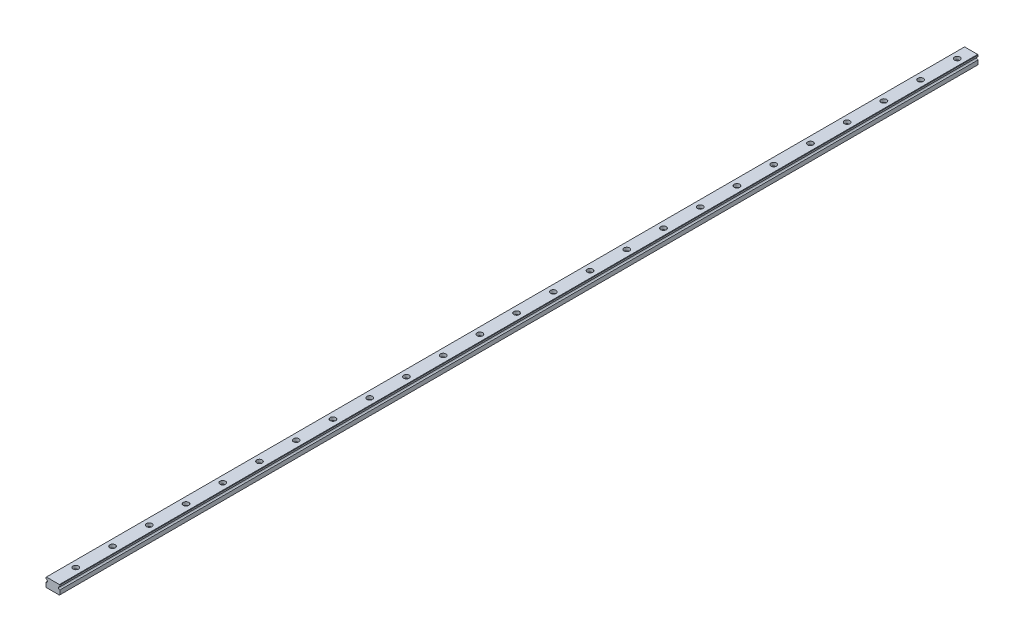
ISO-10303-21;
HEADER;
FILE_DESCRIPTION(('STEP AP214'),'2;1');
FILE_NAME('part.step','',(''),(''),'','','');
FILE_SCHEMA(('AUTOMOTIVE_DESIGN { 1 0 10303 214 1 1 1 1 }'));
ENDSEC;
DATA;
#1=APPLICATION_CONTEXT('core data for automotive mechanical design processes');
#2=APPLICATION_PROTOCOL_DEFINITION('international standard','automotive_design',2000,#1);
#3=PRODUCT_CONTEXT('',#1,'mechanical');
#4=PRODUCT('Part','Part','',(#3));
#5=PRODUCT_RELATED_PRODUCT_CATEGORY('part','',(#4));
#6=PRODUCT_DEFINITION_FORMATION('','',#4);
#7=PRODUCT_DEFINITION_CONTEXT('part definition',#1,'design');
#8=PRODUCT_DEFINITION('design','',#6,#7);
#9=PRODUCT_DEFINITION_SHAPE('','',#8);
#10=(LENGTH_UNIT() NAMED_UNIT(*) SI_UNIT(.MILLI.,.METRE.));
#11=(NAMED_UNIT(*) PLANE_ANGLE_UNIT() SI_UNIT($,.RADIAN.));
#12=(NAMED_UNIT(*) SI_UNIT($,.STERADIAN.) SOLID_ANGLE_UNIT());
#13=UNCERTAINTY_MEASURE_WITH_UNIT(LENGTH_MEASURE(1.E-05),#10,'distance_accuracy_value','');
#14=(GEOMETRIC_REPRESENTATION_CONTEXT(3) GLOBAL_UNCERTAINTY_ASSIGNED_CONTEXT((#13)) GLOBAL_UNIT_ASSIGNED_CONTEXT((#10,
#11,#12)) REPRESENTATION_CONTEXT('',''));
#15=CARTESIAN_POINT('',(0.,0.,0.));
#16=DIRECTION('',(0.,0.,1.));
#17=DIRECTION('',(1.,0.,0.));
#18=AXIS2_PLACEMENT_3D('',#15,#16,#17);
#19=CARTESIAN_POINT('',(6.91312797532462,4.90656398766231,1000.));
#20=DIRECTION('',(0.,-1.,0.));
#21=DIRECTION('',(0.,0.,-1.));
#22=AXIS2_PLACEMENT_3D('',#19,#20,#21);
#23=PLANE('',#22);
#24=CARTESIAN_POINT('',(-0.186872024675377,4.90656398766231,55.0000000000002));
#25=DIRECTION('',(0.,1.,0.));
#26=DIRECTION('',(0.,0.,1.));
#27=AXIS2_PLACEMENT_3D('',#24,#25,#26);
#28=CIRCLE('',#27,3.);
#29=CARTESIAN_POINT('',(-0.186872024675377,4.90656398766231,58.0000000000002));
#30=VERTEX_POINT('',#29);
#31=EDGE_CURVE('E691',#30,#30,#28,.T.);
#32=ORIENTED_EDGE('',*,*,#31,.F.);
#33=EDGE_LOOP('',(#32));
#34=FACE_BOUND('',#33,.T.);
#35=CARTESIAN_POINT('',(-0.186872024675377,4.90656398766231,95.0000000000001));
#36=DIRECTION('',(0.,1.,0.));
#37=DIRECTION('',(0.,0.,1.));
#38=AXIS2_PLACEMENT_3D('',#35,#36,#37);
#39=CIRCLE('',#38,3.);
#40=CARTESIAN_POINT('',(-0.186872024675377,4.90656398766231,98.0000000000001));
#41=VERTEX_POINT('',#40);
#42=EDGE_CURVE('E675',#41,#41,#39,.T.);
#43=ORIENTED_EDGE('',*,*,#42,.F.);
#44=EDGE_LOOP('',(#43));
#45=FACE_BOUND('',#44,.T.);
#46=CARTESIAN_POINT('',(-0.186872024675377,4.90656398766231,135.));
#47=DIRECTION('',(0.,1.,0.));
#48=DIRECTION('',(0.,0.,1.));
#49=AXIS2_PLACEMENT_3D('',#46,#47,#48);
#50=CIRCLE('',#49,3.);
#51=CARTESIAN_POINT('',(-0.186872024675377,4.90656398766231,138.));
#52=VERTEX_POINT('',#51);
#53=EDGE_CURVE('E659',#52,#52,#50,.T.);
#54=ORIENTED_EDGE('',*,*,#53,.F.);
#55=EDGE_LOOP('',(#54));
#56=FACE_BOUND('',#55,.T.);
#57=CARTESIAN_POINT('',(-0.186872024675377,4.90656398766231,374.999999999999));
#58=DIRECTION('',(0.,1.,0.));
#59=DIRECTION('',(0.,0.,1.));
#60=AXIS2_PLACEMENT_3D('',#57,#58,#59);
#61=CIRCLE('',#60,3.);
#62=CARTESIAN_POINT('',(-0.186872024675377,4.90656398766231,377.999999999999));
#63=VERTEX_POINT('',#62);
#64=EDGE_CURVE('E563',#63,#63,#61,.T.);
#65=ORIENTED_EDGE('',*,*,#64,.F.);
#66=EDGE_LOOP('',(#65));
#67=FACE_BOUND('',#66,.T.);
#68=CARTESIAN_POINT('',(-0.186872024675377,4.90656398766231,454.999999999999));
#69=DIRECTION('',(0.,1.,0.));
#70=DIRECTION('',(0.,0.,1.));
#71=AXIS2_PLACEMENT_3D('',#68,#69,#70);
#72=CIRCLE('',#71,3.);
#73=CARTESIAN_POINT('',(-0.186872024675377,4.90656398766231,457.999999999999));
#74=VERTEX_POINT('',#73);
#75=EDGE_CURVE('E531',#74,#74,#72,.T.);
#76=ORIENTED_EDGE('',*,*,#75,.F.);
#77=EDGE_LOOP('',(#76));
#78=FACE_BOUND('',#77,.T.);
#79=CARTESIAN_POINT('',(-0.186872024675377,4.90656398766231,494.999999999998));
#80=DIRECTION('',(0.,1.,0.));
#81=DIRECTION('',(0.,0.,1.));
#82=AXIS2_PLACEMENT_3D('',#79,#80,#81);
#83=CIRCLE('',#82,3.);
#84=CARTESIAN_POINT('',(-0.186872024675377,4.90656398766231,497.999999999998));
#85=VERTEX_POINT('',#84);
#86=EDGE_CURVE('E515',#85,#85,#83,.T.);
#87=ORIENTED_EDGE('',*,*,#86,.F.);
#88=EDGE_LOOP('',(#87));
#89=FACE_BOUND('',#88,.T.);
#90=CARTESIAN_POINT('',(-0.186872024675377,4.90656398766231,654.999999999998));
#91=DIRECTION('',(0.,1.,0.));
#92=DIRECTION('',(0.,0.,1.));
#93=AXIS2_PLACEMENT_3D('',#90,#91,#92);
#94=CIRCLE('',#93,3.);
#95=CARTESIAN_POINT('',(-0.186872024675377,4.90656398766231,657.999999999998));
#96=VERTEX_POINT('',#95);
#97=EDGE_CURVE('E451',#96,#96,#94,.T.);
#98=ORIENTED_EDGE('',*,*,#97,.F.);
#99=EDGE_LOOP('',(#98));
#100=FACE_BOUND('',#99,.T.);
#101=CARTESIAN_POINT('',(-0.186872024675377,4.90656398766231,694.999999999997));
#102=DIRECTION('',(0.,1.,0.));
#103=DIRECTION('',(0.,0.,1.));
#104=AXIS2_PLACEMENT_3D('',#101,#102,#103);
#105=CIRCLE('',#104,3.);
#106=CARTESIAN_POINT('',(-0.186872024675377,4.90656398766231,697.999999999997));
#107=VERTEX_POINT('',#106);
#108=EDGE_CURVE('E435',#107,#107,#105,.T.);
#109=ORIENTED_EDGE('',*,*,#108,.F.);
#110=EDGE_LOOP('',(#109));
#111=FACE_BOUND('',#110,.T.);
#112=CARTESIAN_POINT('',(-0.186872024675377,4.90656398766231,734.999999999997));
#113=DIRECTION('',(0.,1.,0.));
#114=DIRECTION('',(0.,0.,1.));
#115=AXIS2_PLACEMENT_3D('',#112,#113,#114);
#116=CIRCLE('',#115,3.);
#117=CARTESIAN_POINT('',(-0.186872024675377,4.90656398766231,737.999999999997));
#118=VERTEX_POINT('',#117);
#119=EDGE_CURVE('E419',#118,#118,#116,.T.);
#120=ORIENTED_EDGE('',*,*,#119,.F.);
#121=EDGE_LOOP('',(#120));
#122=FACE_BOUND('',#121,.T.);
#123=CARTESIAN_POINT('',(-0.186872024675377,4.90656398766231,774.999999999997));
#124=DIRECTION('',(0.,1.,0.));
#125=DIRECTION('',(0.,0.,1.));
#126=AXIS2_PLACEMENT_3D('',#123,#124,#125);
#127=CIRCLE('',#126,3.);
#128=CARTESIAN_POINT('',(-0.186872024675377,4.90656398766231,777.999999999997));
#129=VERTEX_POINT('',#128);
#130=EDGE_CURVE('E403',#129,#129,#127,.T.);
#131=ORIENTED_EDGE('',*,*,#130,.F.);
#132=EDGE_LOOP('',(#131));
#133=FACE_BOUND('',#132,.T.);
#134=CARTESIAN_POINT('',(-0.186872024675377,4.90656398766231,814.999999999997));
#135=DIRECTION('',(0.,1.,0.));
#136=DIRECTION('',(0.,0.,1.));
#137=AXIS2_PLACEMENT_3D('',#134,#135,#136);
#138=CIRCLE('',#137,3.);
#139=CARTESIAN_POINT('',(-0.186872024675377,4.90656398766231,817.999999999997));
#140=VERTEX_POINT('',#139);
#141=EDGE_CURVE('E387',#140,#140,#138,.T.);
#142=ORIENTED_EDGE('',*,*,#141,.F.);
#143=EDGE_LOOP('',(#142));
#144=FACE_BOUND('',#143,.T.);
#145=CARTESIAN_POINT('',(-0.186872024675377,4.90656398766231,854.999999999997));
#146=DIRECTION('',(0.,1.,0.));
#147=DIRECTION('',(0.,0.,1.));
#148=AXIS2_PLACEMENT_3D('',#145,#146,#147);
#149=CIRCLE('',#148,3.);
#150=CARTESIAN_POINT('',(-0.186872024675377,4.90656398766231,857.999999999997));
#151=VERTEX_POINT('',#150);
#152=EDGE_CURVE('E371',#151,#151,#149,.T.);
#153=ORIENTED_EDGE('',*,*,#152,.F.);
#154=EDGE_LOOP('',(#153));
#155=FACE_BOUND('',#154,.T.);
#156=CARTESIAN_POINT('',(-0.186872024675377,4.90656398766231,894.999999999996));
#157=DIRECTION('',(0.,1.,0.));
#158=DIRECTION('',(0.,0.,1.));
#159=AXIS2_PLACEMENT_3D('',#156,#157,#158);
#160=CIRCLE('',#159,3.);
#161=CARTESIAN_POINT('',(-0.186872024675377,4.90656398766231,897.999999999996));
#162=VERTEX_POINT('',#161);
#163=EDGE_CURVE('E355',#162,#162,#160,.T.);
#164=ORIENTED_EDGE('',*,*,#163,.F.);
#165=EDGE_LOOP('',(#164));
#166=FACE_BOUND('',#165,.T.);
#167=CARTESIAN_POINT('',(-0.186872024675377,4.90656398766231,934.999999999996));
#168=DIRECTION('',(0.,1.,0.));
#169=DIRECTION('',(0.,0.,1.));
#170=AXIS2_PLACEMENT_3D('',#167,#168,#169);
#171=CIRCLE('',#170,3.);
#172=CARTESIAN_POINT('',(-0.186872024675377,4.90656398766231,937.999999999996));
#173=VERTEX_POINT('',#172);
#174=EDGE_CURVE('E339',#173,#173,#171,.T.);
#175=ORIENTED_EDGE('',*,*,#174,.F.);
#176=EDGE_LOOP('',(#175));
#177=FACE_BOUND('',#176,.T.);
#178=CARTESIAN_POINT('',(-0.186872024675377,4.90656398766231,974.999999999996));
#179=DIRECTION('',(0.,1.,0.));
#180=DIRECTION('',(0.,0.,1.));
#181=AXIS2_PLACEMENT_3D('',#178,#179,#180);
#182=CIRCLE('',#181,3.);
#183=CARTESIAN_POINT('',(-0.186872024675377,4.90656398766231,977.999999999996));
#184=VERTEX_POINT('',#183);
#185=EDGE_CURVE('E323',#184,#184,#182,.T.);
#186=ORIENTED_EDGE('',*,*,#185,.F.);
#187=EDGE_LOOP('',(#186));
#188=FACE_BOUND('',#187,.T.);
#189=CARTESIAN_POINT('',(-0.186872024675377,4.90656398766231,15.));
#190=DIRECTION('',(0.,1.,0.));
#191=DIRECTION('',(0.,0.,1.));
#192=AXIS2_PLACEMENT_3D('',#189,#190,#191);
#193=CIRCLE('',#192,3.);
#194=CARTESIAN_POINT('',(-0.186872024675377,4.90656398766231,18.));
#195=VERTEX_POINT('',#194);
#196=EDGE_CURVE('E307',#195,#195,#193,.T.);
#197=ORIENTED_EDGE('',*,*,#196,.F.);
#198=EDGE_LOOP('',(#197));
#199=FACE_BOUND('',#198,.T.);
#200=DIRECTION('',(-1.,0.,0.));
#201=VECTOR('',#200,1.);
#202=CARTESIAN_POINT('',(6.91312797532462,4.90656398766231,0.));
#203=LINE('',#202,#201);
#204=CARTESIAN_POINT('',(6.91312797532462,4.90656398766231,0.));
#205=VERTEX_POINT('',#204);
#206=CARTESIAN_POINT('',(-7.28687202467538,4.90656398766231,0.));
#207=VERTEX_POINT('',#206);
#208=EDGE_CURVE('E188',#205,#207,#203,.T.);
#209=ORIENTED_EDGE('',*,*,#208,.T.);
#210=DIRECTION('',(0.,0.,-1.));
#211=VECTOR('',#210,1.);
#212=CARTESIAN_POINT('',(-7.28687202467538,4.90656398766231,1000.));
#213=LINE('',#212,#211);
#214=CARTESIAN_POINT('',(-7.28687202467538,4.90656398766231,1000.));
#215=VERTEX_POINT('',#214);
#216=EDGE_CURVE('E216',#215,#207,#213,.T.);
#217=ORIENTED_EDGE('',*,*,#216,.F.);
#218=DIRECTION('',(-1.,0.,0.));
#219=VECTOR('',#218,1.);
#220=CARTESIAN_POINT('',(6.91312797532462,4.90656398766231,1000.));
#221=LINE('',#220,#219);
#222=CARTESIAN_POINT('',(6.91312797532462,4.90656398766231,1000.));
#223=VERTEX_POINT('',#222);
#224=EDGE_CURVE('E268',#223,#215,#221,.T.);
#225=ORIENTED_EDGE('',*,*,#224,.F.);
#226=DIRECTION('',(0.,0.,-1.));
#227=VECTOR('',#226,1.);
#228=CARTESIAN_POINT('',(6.91312797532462,4.90656398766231,1000.));
#229=LINE('',#228,#227);
#230=EDGE_CURVE('E220',#223,#205,#229,.T.);
#231=ORIENTED_EDGE('',*,*,#230,.T.);
#232=EDGE_LOOP('',(#209,#217,#225,#231));
#233=FACE_BOUND('',#232,.T.);
#234=CARTESIAN_POINT('',(-0.186872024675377,4.90656398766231,614.999999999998));
#235=DIRECTION('',(0.,1.,0.));
#236=DIRECTION('',(0.,0.,1.));
#237=AXIS2_PLACEMENT_3D('',#234,#235,#236);
#238=CIRCLE('',#237,3.);
#239=CARTESIAN_POINT('',(-0.186872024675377,4.90656398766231,617.999999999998));
#240=VERTEX_POINT('',#239);
#241=EDGE_CURVE('E467',#240,#240,#238,.T.);
#242=ORIENTED_EDGE('',*,*,#241,.F.);
#243=EDGE_LOOP('',(#242));
#244=FACE_BOUND('',#243,.T.);
#245=CARTESIAN_POINT('',(-0.186872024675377,4.90656398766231,574.999999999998));
#246=DIRECTION('',(0.,1.,0.));
#247=DIRECTION('',(0.,0.,1.));
#248=AXIS2_PLACEMENT_3D('',#245,#246,#247);
#249=CIRCLE('',#248,3.);
#250=CARTESIAN_POINT('',(-0.186872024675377,4.90656398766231,577.999999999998));
#251=VERTEX_POINT('',#250);
#252=EDGE_CURVE('E483',#251,#251,#249,.T.);
#253=ORIENTED_EDGE('',*,*,#252,.F.);
#254=EDGE_LOOP('',(#253));
#255=FACE_BOUND('',#254,.T.);
#256=CARTESIAN_POINT('',(-0.186872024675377,4.90656398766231,534.999999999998));
#257=DIRECTION('',(0.,1.,0.));
#258=DIRECTION('',(0.,0.,1.));
#259=AXIS2_PLACEMENT_3D('',#256,#257,#258);
#260=CIRCLE('',#259,3.);
#261=CARTESIAN_POINT('',(-0.186872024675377,4.90656398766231,537.999999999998));
#262=VERTEX_POINT('',#261);
#263=EDGE_CURVE('E499',#262,#262,#260,.T.);
#264=ORIENTED_EDGE('',*,*,#263,.F.);
#265=EDGE_LOOP('',(#264));
#266=FACE_BOUND('',#265,.T.);
#267=CARTESIAN_POINT('',(-0.186872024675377,4.90656398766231,414.999999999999));
#268=DIRECTION('',(0.,1.,0.));
#269=DIRECTION('',(0.,0.,1.));
#270=AXIS2_PLACEMENT_3D('',#267,#268,#269);
#271=CIRCLE('',#270,3.);
#272=CARTESIAN_POINT('',(-0.186872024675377,4.90656398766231,417.999999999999));
#273=VERTEX_POINT('',#272);
#274=EDGE_CURVE('E547',#273,#273,#271,.T.);
#275=ORIENTED_EDGE('',*,*,#274,.F.);
#276=EDGE_LOOP('',(#275));
#277=FACE_BOUND('',#276,.T.);
#278=CARTESIAN_POINT('',(-0.186872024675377,4.90656398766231,334.999999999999));
#279=DIRECTION('',(0.,1.,0.));
#280=DIRECTION('',(0.,0.,1.));
#281=AXIS2_PLACEMENT_3D('',#278,#279,#280);
#282=CIRCLE('',#281,3.);
#283=CARTESIAN_POINT('',(-0.186872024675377,4.90656398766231,337.999999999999));
#284=VERTEX_POINT('',#283);
#285=EDGE_CURVE('E579',#284,#284,#282,.T.);
#286=ORIENTED_EDGE('',*,*,#285,.F.);
#287=EDGE_LOOP('',(#286));
#288=FACE_BOUND('',#287,.T.);
#289=CARTESIAN_POINT('',(-0.186872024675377,4.90656398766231,294.999999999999));
#290=DIRECTION('',(0.,1.,0.));
#291=DIRECTION('',(0.,0.,1.));
#292=AXIS2_PLACEMENT_3D('',#289,#290,#291);
#293=CIRCLE('',#292,3.);
#294=CARTESIAN_POINT('',(-0.186872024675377,4.90656398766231,297.999999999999));
#295=VERTEX_POINT('',#294);
#296=EDGE_CURVE('E595',#295,#295,#293,.T.);
#297=ORIENTED_EDGE('',*,*,#296,.F.);
#298=EDGE_LOOP('',(#297));
#299=FACE_BOUND('',#298,.T.);
#300=CARTESIAN_POINT('',(-0.186872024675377,4.90656398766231,254.999999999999));
#301=DIRECTION('',(0.,1.,0.));
#302=DIRECTION('',(0.,0.,1.));
#303=AXIS2_PLACEMENT_3D('',#300,#301,#302);
#304=CIRCLE('',#303,3.);
#305=CARTESIAN_POINT('',(-0.186872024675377,4.90656398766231,257.999999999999));
#306=VERTEX_POINT('',#305);
#307=EDGE_CURVE('E611',#306,#306,#304,.T.);
#308=ORIENTED_EDGE('',*,*,#307,.F.);
#309=EDGE_LOOP('',(#308));
#310=FACE_BOUND('',#309,.T.);
#311=CARTESIAN_POINT('',(-0.186872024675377,4.90656398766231,215.));
#312=DIRECTION('',(0.,1.,0.));
#313=DIRECTION('',(0.,0.,1.));
#314=AXIS2_PLACEMENT_3D('',#311,#312,#313);
#315=CIRCLE('',#314,3.);
#316=CARTESIAN_POINT('',(-0.186872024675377,4.90656398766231,218.));
#317=VERTEX_POINT('',#316);
#318=EDGE_CURVE('E627',#317,#317,#315,.T.);
#319=ORIENTED_EDGE('',*,*,#318,.F.);
#320=EDGE_LOOP('',(#319));
#321=FACE_BOUND('',#320,.T.);
#322=CARTESIAN_POINT('',(-0.186872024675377,4.90656398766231,175.));
#323=DIRECTION('',(0.,1.,0.));
#324=DIRECTION('',(0.,0.,1.));
#325=AXIS2_PLACEMENT_3D('',#322,#323,#324);
#326=CIRCLE('',#325,3.);
#327=CARTESIAN_POINT('',(-0.186872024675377,4.90656398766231,178.));
#328=VERTEX_POINT('',#327);
#329=EDGE_CURVE('E643',#328,#328,#326,.T.);
#330=ORIENTED_EDGE('',*,*,#329,.F.);
#331=EDGE_LOOP('',(#330));
#332=FACE_BOUND('',#331,.T.);
#333=ADVANCED_FACE('F45',(#34,#45,#56,#67,#78,#89,#100,#111,#122,#133,#144,#155,#166,#177,#188,
#199,#233,#244,#255,#266,#277,#288,#299,#310,#321,#332),#23,.F.);
#334=CARTESIAN_POINT('',(6.91312797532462,-5.09343601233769,1000.));
#335=DIRECTION('',(-0.707106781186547,0.707106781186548,0.));
#336=DIRECTION('',(-0.707106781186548,-0.707106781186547,0.));
#337=AXIS2_PLACEMENT_3D('',#334,#335,#336);
#338=PLANE('',#337);
#339=DIRECTION('',(0.707106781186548,0.707106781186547,0.));
#340=VECTOR('',#339,1.);
#341=CARTESIAN_POINT('',(6.91312797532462,-5.09343601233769,0.));
#342=LINE('',#341,#340);
#343=CARTESIAN_POINT('',(6.91312797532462,-5.09343601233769,0.));
#344=VERTEX_POINT('',#343);
#345=CARTESIAN_POINT('',(7.31312797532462,-4.69343601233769,0.));
#346=VERTEX_POINT('',#345);
#347=EDGE_CURVE('E171',#344,#346,#342,.T.);
#348=ORIENTED_EDGE('',*,*,#347,.T.);
#349=DIRECTION('',(0.,0.,-1.));
#350=VECTOR('',#349,1.);
#351=CARTESIAN_POINT('',(7.31312797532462,-4.69343601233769,1000.));
#352=LINE('',#351,#350);
#353=CARTESIAN_POINT('',(7.31312797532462,-4.69343601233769,1000.));
#354=VERTEX_POINT('',#353);
#355=EDGE_CURVE('E55',#354,#346,#352,.T.);
#356=ORIENTED_EDGE('',*,*,#355,.F.);
#357=DIRECTION('',(0.707106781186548,0.707106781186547,0.));
#358=VECTOR('',#357,1.);
#359=CARTESIAN_POINT('',(6.91312797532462,-5.09343601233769,1000.));
#360=LINE('',#359,#358);
#361=CARTESIAN_POINT('',(6.91312797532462,-5.09343601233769,1000.));
#362=VERTEX_POINT('',#361);
#363=EDGE_CURVE('E289',#362,#354,#360,.T.);
#364=ORIENTED_EDGE('',*,*,#363,.F.);
#365=DIRECTION('',(0.,0.,-1.));
#366=VECTOR('',#365,1.);
#367=CARTESIAN_POINT('',(6.91312797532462,-5.09343601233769,1000.));
#368=LINE('',#367,#366);
#369=EDGE_CURVE('E12',#362,#344,#368,.T.);
#370=ORIENTED_EDGE('',*,*,#369,.T.);
#371=EDGE_LOOP('',(#348,#356,#364,#370));
#372=FACE_BOUND('',#371,.T.);
#373=ADVANCED_FACE('F47',(#372),#338,.F.);
#374=CARTESIAN_POINT('',(7.31312797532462,-4.69343601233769,1000.));
#375=DIRECTION('',(-1.,0.,0.));
#376=DIRECTION('',(0.,0.,1.));
#377=AXIS2_PLACEMENT_3D('',#374,#375,#376);
#378=PLANE('',#377);
#379=DIRECTION('',(0.,1.,0.));
#380=VECTOR('',#379,1.);
#381=CARTESIAN_POINT('',(7.31312797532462,-4.69343601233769,0.));
#382=LINE('',#381,#380);
#383=CARTESIAN_POINT('',(7.31312797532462,-0.0934360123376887,0.));
#384=VERTEX_POINT('',#383);
#385=EDGE_CURVE('E174',#346,#384,#382,.T.);
#386=ORIENTED_EDGE('',*,*,#385,.T.);
#387=DIRECTION('',(0.,0.,-1.));
#388=VECTOR('',#387,1.);
#389=CARTESIAN_POINT('',(7.31312797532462,-0.0934360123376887,1000.));
#390=LINE('',#389,#388);
#391=CARTESIAN_POINT('',(7.31312797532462,-0.0934360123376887,1000.));
#392=VERTEX_POINT('',#391);
#393=EDGE_CURVE('E232',#392,#384,#390,.T.);
#394=ORIENTED_EDGE('',*,*,#393,.F.);
#395=DIRECTION('',(0.,1.,0.));
#396=VECTOR('',#395,1.);
#397=CARTESIAN_POINT('',(7.31312797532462,-4.69343601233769,1000.));
#398=LINE('',#397,#396);
#399=EDGE_CURVE('E243',#354,#392,#398,.T.);
#400=ORIENTED_EDGE('',*,*,#399,.F.);
#401=ORIENTED_EDGE('',*,*,#355,.T.);
#402=EDGE_LOOP('',(#386,#394,#400,#401));
#403=FACE_BOUND('',#402,.T.);
#404=ADVANCED_FACE('F241',(#403),#378,.F.);
#405=CARTESIAN_POINT('',(7.31312797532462,1.40656398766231,1000.));
#406=DIRECTION('',(0.,0.,-1.));
#407=DIRECTION('',(-1.,0.,0.));
#408=AXIS2_PLACEMENT_3D('',#405,#406,#407);
#409=CYLINDRICAL_SURFACE('',#408,1.5);
#410=CARTESIAN_POINT('',(7.31312797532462,1.40656398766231,0.));
#411=DIRECTION('',(0.,0.,-1.));
#412=DIRECTION('',(1.,0.,0.));
#413=AXIS2_PLACEMENT_3D('',#410,#411,#412);
#414=CIRCLE('',#413,1.5);
#415=CARTESIAN_POINT('',(7.31312797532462,2.90656398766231,0.));
#416=VERTEX_POINT('',#415);
#417=EDGE_CURVE('E179',#384,#416,#414,.T.);
#418=ORIENTED_EDGE('',*,*,#417,.T.);
#419=DIRECTION('',(0.,0.,-1.));
#420=VECTOR('',#419,1.);
#421=CARTESIAN_POINT('',(7.31312797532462,2.90656398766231,1000.));
#422=LINE('',#421,#420);
#423=CARTESIAN_POINT('',(7.31312797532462,2.90656398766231,1000.));
#424=VERTEX_POINT('',#423);
#425=EDGE_CURVE('E228',#424,#416,#422,.T.);
#426=ORIENTED_EDGE('',*,*,#425,.F.);
#427=CARTESIAN_POINT('',(7.31312797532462,1.40656398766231,1000.));
#428=DIRECTION('',(0.,0.,-1.));
#429=DIRECTION('',(1.,0.,0.));
#430=AXIS2_PLACEMENT_3D('',#427,#428,#429);
#431=CIRCLE('',#430,1.5);
#432=EDGE_CURVE('E264',#392,#424,#431,.T.);
#433=ORIENTED_EDGE('',*,*,#432,.F.);
#434=ORIENTED_EDGE('',*,*,#393,.T.);
#435=EDGE_LOOP('',(#418,#426,#433,#434));
#436=FACE_BOUND('',#435,.T.);
#437=ADVANCED_FACE('F254',(#436),#409,.F.);
#438=CARTESIAN_POINT('',(7.31312797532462,2.90656398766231,1000.));
#439=DIRECTION('',(-1.,0.,0.));
#440=DIRECTION('',(0.,0.,1.));
#441=AXIS2_PLACEMENT_3D('',#438,#439,#440);
#442=PLANE('',#441);
#443=DIRECTION('',(0.,1.,0.));
#444=VECTOR('',#443,1.);
#445=CARTESIAN_POINT('',(7.31312797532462,2.90656398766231,0.));
#446=LINE('',#445,#444);
#447=CARTESIAN_POINT('',(7.31312797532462,4.50656398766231,0.));
#448=VERTEX_POINT('',#447);
#449=EDGE_CURVE('E182',#416,#448,#446,.T.);
#450=ORIENTED_EDGE('',*,*,#449,.T.);
#451=DIRECTION('',(0.,0.,-1.));
#452=VECTOR('',#451,1.);
#453=CARTESIAN_POINT('',(7.31312797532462,4.50656398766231,1000.));
#454=LINE('',#453,#452);
#455=CARTESIAN_POINT('',(7.31312797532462,4.50656398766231,1000.));
#456=VERTEX_POINT('',#455);
#457=EDGE_CURVE('E224',#456,#448,#454,.T.);
#458=ORIENTED_EDGE('',*,*,#457,.F.);
#459=DIRECTION('',(0.,1.,0.));
#460=VECTOR('',#459,1.);
#461=CARTESIAN_POINT('',(7.31312797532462,2.90656398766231,1000.));
#462=LINE('',#461,#460);
#463=EDGE_CURVE('E260',#424,#456,#462,.T.);
#464=ORIENTED_EDGE('',*,*,#463,.F.);
#465=ORIENTED_EDGE('',*,*,#425,.T.);
#466=EDGE_LOOP('',(#450,#458,#464,#465));
#467=FACE_BOUND('',#466,.T.);
#468=ADVANCED_FACE('F258',(#467),#442,.F.);
#469=CARTESIAN_POINT('',(7.31312797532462,4.50656398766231,1000.));
#470=DIRECTION('',(-0.707106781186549,-0.707106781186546,0.));
#471=DIRECTION('',(0.707106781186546,-0.707106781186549,0.));
#472=AXIS2_PLACEMENT_3D('',#469,#470,#471);
#473=PLANE('',#472);
#474=DIRECTION('',(-0.707106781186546,0.707106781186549,0.));
#475=VECTOR('',#474,1.);
#476=CARTESIAN_POINT('',(7.31312797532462,4.50656398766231,0.));
#477=LINE('',#476,#475);
#478=EDGE_CURVE('E185',#448,#205,#477,.T.);
#479=ORIENTED_EDGE('',*,*,#478,.T.);
#480=ORIENTED_EDGE('',*,*,#230,.F.);
#481=DIRECTION('',(-0.707106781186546,0.707106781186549,0.));
#482=VECTOR('',#481,1.);
#483=CARTESIAN_POINT('',(7.31312797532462,4.50656398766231,1000.));
#484=LINE('',#483,#482);
#485=EDGE_CURVE('E263',#456,#223,#484,.T.);
#486=ORIENTED_EDGE('',*,*,#485,.F.);
#487=ORIENTED_EDGE('',*,*,#457,.T.);
#488=EDGE_LOOP('',(#479,#480,#486,#487));
#489=FACE_BOUND('',#488,.T.);
#490=ADVANCED_FACE('F1042',(#489),#473,.F.);
#491=CARTESIAN_POINT('',(-7.28687202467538,4.90656398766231,1000.));
#492=DIRECTION('',(0.707106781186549,-0.707106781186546,0.));
#493=DIRECTION('',(0.707106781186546,0.707106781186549,0.));
#494=AXIS2_PLACEMENT_3D('',#491,#492,#493);
#495=PLANE('',#494);
#496=DIRECTION('',(-0.707106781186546,-0.707106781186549,0.));
#497=VECTOR('',#496,1.);
#498=CARTESIAN_POINT('',(-7.28687202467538,4.90656398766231,0.));
#499=LINE('',#498,#497);
#500=CARTESIAN_POINT('',(-7.68687202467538,4.50656398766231,0.));
#501=VERTEX_POINT('',#500);
#502=EDGE_CURVE('E191',#207,#501,#499,.T.);
#503=ORIENTED_EDGE('',*,*,#502,.T.);
#504=DIRECTION('',(0.,0.,-1.));
#505=VECTOR('',#504,1.);
#506=CARTESIAN_POINT('',(-7.68687202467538,4.50656398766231,1000.));
#507=LINE('',#506,#505);
#508=CARTESIAN_POINT('',(-7.68687202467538,4.50656398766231,1000.));
#509=VERTEX_POINT('',#508);
#510=EDGE_CURVE('E212',#509,#501,#507,.T.);
#511=ORIENTED_EDGE('',*,*,#510,.F.);
#512=DIRECTION('',(-0.707106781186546,-0.707106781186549,0.));
#513=VECTOR('',#512,1.);
#514=CARTESIAN_POINT('',(-7.28687202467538,4.90656398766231,1000.));
#515=LINE('',#514,#513);
#516=EDGE_CURVE('E275',#215,#509,#515,.T.);
#517=ORIENTED_EDGE('',*,*,#516,.F.);
#518=ORIENTED_EDGE('',*,*,#216,.T.);
#519=EDGE_LOOP('',(#503,#511,#517,#518));
#520=FACE_BOUND('',#519,.T.);
#521=ADVANCED_FACE('F283',(#520),#495,.F.);
#522=CARTESIAN_POINT('',(-7.68687202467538,4.50656398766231,1000.));
#523=DIRECTION('',(1.,0.,0.));
#524=DIRECTION('',(0.,0.,-1.));
#525=AXIS2_PLACEMENT_3D('',#522,#523,#524);
#526=PLANE('',#525);
#527=DIRECTION('',(0.,-1.,0.));
#528=VECTOR('',#527,1.);
#529=CARTESIAN_POINT('',(-7.68687202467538,4.50656398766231,0.));
#530=LINE('',#529,#528);
#531=CARTESIAN_POINT('',(-7.68687202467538,2.90656398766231,0.));
#532=VERTEX_POINT('',#531);
#533=EDGE_CURVE('E194',#501,#532,#530,.T.);
#534=ORIENTED_EDGE('',*,*,#533,.T.);
#535=DIRECTION('',(0.,0.,-1.));
#536=VECTOR('',#535,1.);
#537=CARTESIAN_POINT('',(-7.68687202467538,2.90656398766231,1000.));
#538=LINE('',#537,#536);
#539=CARTESIAN_POINT('',(-7.68687202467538,2.90656398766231,1000.));
#540=VERTEX_POINT('',#539);
#541=EDGE_CURVE('E158',#540,#532,#538,.T.);
#542=ORIENTED_EDGE('',*,*,#541,.F.);
#543=DIRECTION('',(0.,-1.,0.));
#544=VECTOR('',#543,1.);
#545=CARTESIAN_POINT('',(-7.68687202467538,4.50656398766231,1000.));
#546=LINE('',#545,#544);
#547=EDGE_CURVE('E147',#509,#540,#546,.T.);
#548=ORIENTED_EDGE('',*,*,#547,.F.);
#549=ORIENTED_EDGE('',*,*,#510,.T.);
#550=EDGE_LOOP('',(#534,#542,#548,#549));
#551=FACE_BOUND('',#550,.T.);
#552=ADVANCED_FACE('F287',(#551),#526,.F.);
#553=CARTESIAN_POINT('',(-7.68687202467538,1.40656398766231,1000.));
#554=DIRECTION('',(0.,0.,-1.));
#555=DIRECTION('',(-1.,0.,0.));
#556=AXIS2_PLACEMENT_3D('',#553,#554,#555);
#557=CYLINDRICAL_SURFACE('',#556,1.5);
#558=CARTESIAN_POINT('',(-7.68687202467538,1.40656398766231,0.));
#559=DIRECTION('',(0.,0.,-1.));
#560=DIRECTION('',(1.,0.,0.));
#561=AXIS2_PLACEMENT_3D('',#558,#559,#560);
#562=CIRCLE('',#561,1.5);
#563=CARTESIAN_POINT('',(-7.68687202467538,-0.0934360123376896,0.));
#564=VERTEX_POINT('',#563);
#565=EDGE_CURVE('E156',#532,#564,#562,.T.);
#566=ORIENTED_EDGE('',*,*,#565,.T.);
#567=DIRECTION('',(0.,0.,-1.));
#568=VECTOR('',#567,1.);
#569=CARTESIAN_POINT('',(-7.68687202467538,-0.0934360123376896,1000.));
#570=LINE('',#569,#568);
#571=CARTESIAN_POINT('',(-7.68687202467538,-0.0934360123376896,1000.));
#572=VERTEX_POINT('',#571);
#573=EDGE_CURVE('E153',#572,#564,#570,.T.);
#574=ORIENTED_EDGE('',*,*,#573,.F.);
#575=CARTESIAN_POINT('',(-7.68687202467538,1.40656398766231,1000.));
#576=DIRECTION('',(0.,0.,-1.));
#577=DIRECTION('',(1.,0.,0.));
#578=AXIS2_PLACEMENT_3D('',#575,#576,#577);
#579=CIRCLE('',#578,1.5);
#580=EDGE_CURVE('E141',#540,#572,#579,.T.);
#581=ORIENTED_EDGE('',*,*,#580,.F.);
#582=ORIENTED_EDGE('',*,*,#541,.T.);
#583=EDGE_LOOP('',(#566,#574,#581,#582));
#584=FACE_BOUND('',#583,.T.);
#585=ADVANCED_FACE('F154',(#584),#557,.F.);
#586=CARTESIAN_POINT('',(-7.68687202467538,-0.0934360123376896,1000.));
#587=DIRECTION('',(1.,0.,0.));
#588=DIRECTION('',(0.,0.,-1.));
#589=AXIS2_PLACEMENT_3D('',#586,#587,#588);
#590=PLANE('',#589);
#591=DIRECTION('',(0.,-1.,0.));
#592=VECTOR('',#591,1.);
#593=CARTESIAN_POINT('',(-7.68687202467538,-0.0934360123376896,0.));
#594=LINE('',#593,#592);
#595=CARTESIAN_POINT('',(-7.68687202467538,-4.69343601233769,0.));
#596=VERTEX_POINT('',#595);
#597=EDGE_CURVE('E105',#564,#596,#594,.T.);
#598=ORIENTED_EDGE('',*,*,#597,.T.);
#599=DIRECTION('',(0.,0.,-1.));
#600=VECTOR('',#599,1.);
#601=CARTESIAN_POINT('',(-7.68687202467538,-4.69343601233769,1000.));
#602=LINE('',#601,#600);
#603=CARTESIAN_POINT('',(-7.68687202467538,-4.69343601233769,1000.));
#604=VERTEX_POINT('',#603);
#605=EDGE_CURVE('E159',#604,#596,#602,.T.);
#606=ORIENTED_EDGE('',*,*,#605,.F.);
#607=DIRECTION('',(0.,-1.,0.));
#608=VECTOR('',#607,1.);
#609=CARTESIAN_POINT('',(-7.68687202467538,-0.0934360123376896,1000.));
#610=LINE('',#609,#608);
#611=EDGE_CURVE('E145',#572,#604,#610,.T.);
#612=ORIENTED_EDGE('',*,*,#611,.F.);
#613=ORIENTED_EDGE('',*,*,#573,.T.);
#614=EDGE_LOOP('',(#598,#606,#612,#613));
#615=FACE_BOUND('',#614,.T.);
#616=ADVANCED_FACE('F161',(#615),#590,.F.);
#617=CARTESIAN_POINT('',(-7.68687202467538,-4.69343601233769,1000.));
#618=DIRECTION('',(0.707106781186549,0.707106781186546,0.));
#619=DIRECTION('',(-0.707106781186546,0.707106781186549,0.));
#620=AXIS2_PLACEMENT_3D('',#617,#618,#619);
#621=PLANE('',#620);
#622=DIRECTION('',(0.707106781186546,-0.707106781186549,0.));
#623=VECTOR('',#622,1.);
#624=CARTESIAN_POINT('',(-7.68687202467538,-4.69343601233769,0.));
#625=LINE('',#624,#623);
#626=CARTESIAN_POINT('',(-7.28687202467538,-5.09343601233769,0.));
#627=VERTEX_POINT('',#626);
#628=EDGE_CURVE('E112',#596,#627,#625,.T.);
#629=ORIENTED_EDGE('',*,*,#628,.T.);
#630=DIRECTION('',(0.,0.,-1.));
#631=VECTOR('',#630,1.);
#632=CARTESIAN_POINT('',(-7.28687202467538,-5.09343601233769,1000.));
#633=LINE('',#632,#631);
#634=CARTESIAN_POINT('',(-7.28687202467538,-5.09343601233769,1000.));
#635=VERTEX_POINT('',#634);
#636=EDGE_CURVE('E167',#635,#627,#633,.T.);
#637=ORIENTED_EDGE('',*,*,#636,.F.);
#638=DIRECTION('',(0.707106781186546,-0.707106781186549,0.));
#639=VECTOR('',#638,1.);
#640=CARTESIAN_POINT('',(-7.68687202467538,-4.69343601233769,1000.));
#641=LINE('',#640,#639);
#642=EDGE_CURVE('E164',#604,#635,#641,.T.);
#643=ORIENTED_EDGE('',*,*,#642,.F.);
#644=ORIENTED_EDGE('',*,*,#605,.T.);
#645=EDGE_LOOP('',(#629,#637,#643,#644));
#646=FACE_BOUND('',#645,.T.);
#647=ADVANCED_FACE('F1031',(#646),#621,.F.);
#648=CARTESIAN_POINT('',(-7.28687202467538,-5.09343601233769,1000.));
#649=DIRECTION('',(0.,1.,0.));
#650=DIRECTION('',(-1.,0.,0.));
#651=AXIS2_PLACEMENT_3D('',#648,#649,#650);
#652=PLANE('',#651);
#653=CARTESIAN_POINT('',(-0.186872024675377,-5.09343601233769,55.0000000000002));
#654=DIRECTION('',(0.,1.,0.));
#655=DIRECTION('',(0.,0.,1.));
#656=AXIS2_PLACEMENT_3D('',#653,#654,#655);
#657=CIRCLE('',#656,1.75);
#658=CARTESIAN_POINT('',(-0.186872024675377,-5.09343601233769,56.7500000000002));
#659=VERTEX_POINT('',#658);
#660=EDGE_CURVE('E679',#659,#659,#657,.T.);
#661=ORIENTED_EDGE('',*,*,#660,.T.);
#662=EDGE_LOOP('',(#661));
#663=FACE_BOUND('',#662,.T.);
#664=CARTESIAN_POINT('',(-0.186872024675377,-5.09343601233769,95.0000000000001));
#665=DIRECTION('',(0.,1.,0.));
#666=DIRECTION('',(0.,0.,1.));
#667=AXIS2_PLACEMENT_3D('',#664,#665,#666);
#668=CIRCLE('',#667,1.75);
#669=CARTESIAN_POINT('',(-0.186872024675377,-5.09343601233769,96.7500000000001));
#670=VERTEX_POINT('',#669);
#671=EDGE_CURVE('E663',#670,#670,#668,.T.);
#672=ORIENTED_EDGE('',*,*,#671,.T.);
#673=EDGE_LOOP('',(#672));
#674=FACE_BOUND('',#673,.T.);
#675=CARTESIAN_POINT('',(-0.186872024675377,-5.09343601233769,135.));
#676=DIRECTION('',(0.,1.,0.));
#677=DIRECTION('',(0.,0.,1.));
#678=AXIS2_PLACEMENT_3D('',#675,#676,#677);
#679=CIRCLE('',#678,1.75);
#680=CARTESIAN_POINT('',(-0.186872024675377,-5.09343601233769,136.75));
#681=VERTEX_POINT('',#680);
#682=EDGE_CURVE('E647',#681,#681,#679,.T.);
#683=ORIENTED_EDGE('',*,*,#682,.T.);
#684=EDGE_LOOP('',(#683));
#685=FACE_BOUND('',#684,.T.);
#686=CARTESIAN_POINT('',(-0.186872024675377,-5.09343601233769,175.));
#687=DIRECTION('',(0.,1.,0.));
#688=DIRECTION('',(0.,0.,1.));
#689=AXIS2_PLACEMENT_3D('',#686,#687,#688);
#690=CIRCLE('',#689,1.75);
#691=CARTESIAN_POINT('',(-0.186872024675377,-5.09343601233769,176.75));
#692=VERTEX_POINT('',#691);
#693=EDGE_CURVE('E631',#692,#692,#690,.T.);
#694=ORIENTED_EDGE('',*,*,#693,.T.);
#695=EDGE_LOOP('',(#694));
#696=FACE_BOUND('',#695,.T.);
#697=CARTESIAN_POINT('',(-0.186872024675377,-5.09343601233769,215.));
#698=DIRECTION('',(0.,1.,0.));
#699=DIRECTION('',(0.,0.,1.));
#700=AXIS2_PLACEMENT_3D('',#697,#698,#699);
#701=CIRCLE('',#700,1.75);
#702=CARTESIAN_POINT('',(-0.186872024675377,-5.09343601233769,216.75));
#703=VERTEX_POINT('',#702);
#704=EDGE_CURVE('E615',#703,#703,#701,.T.);
#705=ORIENTED_EDGE('',*,*,#704,.T.);
#706=EDGE_LOOP('',(#705));
#707=FACE_BOUND('',#706,.T.);
#708=CARTESIAN_POINT('',(-0.186872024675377,-5.09343601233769,254.999999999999));
#709=DIRECTION('',(0.,1.,0.));
#710=DIRECTION('',(0.,0.,1.));
#711=AXIS2_PLACEMENT_3D('',#708,#709,#710);
#712=CIRCLE('',#711,1.75);
#713=CARTESIAN_POINT('',(-0.186872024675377,-5.09343601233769,256.749999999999));
#714=VERTEX_POINT('',#713);
#715=EDGE_CURVE('E599',#714,#714,#712,.T.);
#716=ORIENTED_EDGE('',*,*,#715,.T.);
#717=EDGE_LOOP('',(#716));
#718=FACE_BOUND('',#717,.T.);
#719=CARTESIAN_POINT('',(-0.186872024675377,-5.09343601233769,294.999999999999));
#720=DIRECTION('',(0.,1.,0.));
#721=DIRECTION('',(0.,0.,1.));
#722=AXIS2_PLACEMENT_3D('',#719,#720,#721);
#723=CIRCLE('',#722,1.75);
#724=CARTESIAN_POINT('',(-0.186872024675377,-5.09343601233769,296.749999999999));
#725=VERTEX_POINT('',#724);
#726=EDGE_CURVE('E583',#725,#725,#723,.T.);
#727=ORIENTED_EDGE('',*,*,#726,.T.);
#728=EDGE_LOOP('',(#727));
#729=FACE_BOUND('',#728,.T.);
#730=CARTESIAN_POINT('',(-0.186872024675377,-5.09343601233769,334.999999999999));
#731=DIRECTION('',(0.,1.,0.));
#732=DIRECTION('',(0.,0.,1.));
#733=AXIS2_PLACEMENT_3D('',#730,#731,#732);
#734=CIRCLE('',#733,1.75);
#735=CARTESIAN_POINT('',(-0.186872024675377,-5.09343601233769,336.749999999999));
#736=VERTEX_POINT('',#735);
#737=EDGE_CURVE('E567',#736,#736,#734,.T.);
#738=ORIENTED_EDGE('',*,*,#737,.T.);
#739=EDGE_LOOP('',(#738));
#740=FACE_BOUND('',#739,.T.);
#741=CARTESIAN_POINT('',(-0.186872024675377,-5.09343601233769,374.999999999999));
#742=DIRECTION('',(0.,1.,0.));
#743=DIRECTION('',(0.,0.,1.));
#744=AXIS2_PLACEMENT_3D('',#741,#742,#743);
#745=CIRCLE('',#744,1.75);
#746=CARTESIAN_POINT('',(-0.186872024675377,-5.09343601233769,376.749999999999));
#747=VERTEX_POINT('',#746);
#748=EDGE_CURVE('E551',#747,#747,#745,.T.);
#749=ORIENTED_EDGE('',*,*,#748,.T.);
#750=EDGE_LOOP('',(#749));
#751=FACE_BOUND('',#750,.T.);
#752=CARTESIAN_POINT('',(-0.186872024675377,-5.09343601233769,414.999999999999));
#753=DIRECTION('',(0.,1.,0.));
#754=DIRECTION('',(0.,0.,1.));
#755=AXIS2_PLACEMENT_3D('',#752,#753,#754);
#756=CIRCLE('',#755,1.75);
#757=CARTESIAN_POINT('',(-0.186872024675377,-5.09343601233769,416.749999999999));
#758=VERTEX_POINT('',#757);
#759=EDGE_CURVE('E535',#758,#758,#756,.T.);
#760=ORIENTED_EDGE('',*,*,#759,.T.);
#761=EDGE_LOOP('',(#760));
#762=FACE_BOUND('',#761,.T.);
#763=CARTESIAN_POINT('',(-0.186872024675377,-5.09343601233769,454.999999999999));
#764=DIRECTION('',(0.,1.,0.));
#765=DIRECTION('',(0.,0.,1.));
#766=AXIS2_PLACEMENT_3D('',#763,#764,#765);
#767=CIRCLE('',#766,1.75);
#768=CARTESIAN_POINT('',(-0.186872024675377,-5.09343601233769,456.749999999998));
#769=VERTEX_POINT('',#768);
#770=EDGE_CURVE('E519',#769,#769,#767,.T.);
#771=ORIENTED_EDGE('',*,*,#770,.T.);
#772=EDGE_LOOP('',(#771));
#773=FACE_BOUND('',#772,.T.);
#774=CARTESIAN_POINT('',(-0.186872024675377,-5.09343601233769,494.999999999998));
#775=DIRECTION('',(0.,1.,0.));
#776=DIRECTION('',(0.,0.,1.));
#777=AXIS2_PLACEMENT_3D('',#774,#775,#776);
#778=CIRCLE('',#777,1.75);
#779=CARTESIAN_POINT('',(-0.186872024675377,-5.09343601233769,496.749999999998));
#780=VERTEX_POINT('',#779);
#781=EDGE_CURVE('E503',#780,#780,#778,.T.);
#782=ORIENTED_EDGE('',*,*,#781,.T.);
#783=EDGE_LOOP('',(#782));
#784=FACE_BOUND('',#783,.T.);
#785=CARTESIAN_POINT('',(-0.186872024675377,-5.09343601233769,534.999999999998));
#786=DIRECTION('',(0.,1.,0.));
#787=DIRECTION('',(0.,0.,1.));
#788=AXIS2_PLACEMENT_3D('',#785,#786,#787);
#789=CIRCLE('',#788,1.75);
#790=CARTESIAN_POINT('',(-0.186872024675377,-5.09343601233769,536.749999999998));
#791=VERTEX_POINT('',#790);
#792=EDGE_CURVE('E487',#791,#791,#789,.T.);
#793=ORIENTED_EDGE('',*,*,#792,.T.);
#794=EDGE_LOOP('',(#793));
#795=FACE_BOUND('',#794,.T.);
#796=CARTESIAN_POINT('',(-0.186872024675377,-5.09343601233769,574.999999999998));
#797=DIRECTION('',(0.,1.,0.));
#798=DIRECTION('',(0.,0.,1.));
#799=AXIS2_PLACEMENT_3D('',#796,#797,#798);
#800=CIRCLE('',#799,1.75);
#801=CARTESIAN_POINT('',(-0.186872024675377,-5.09343601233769,576.749999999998));
#802=VERTEX_POINT('',#801);
#803=EDGE_CURVE('E471',#802,#802,#800,.T.);
#804=ORIENTED_EDGE('',*,*,#803,.T.);
#805=EDGE_LOOP('',(#804));
#806=FACE_BOUND('',#805,.T.);
#807=CARTESIAN_POINT('',(-0.186872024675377,-5.09343601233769,614.999999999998));
#808=DIRECTION('',(0.,1.,0.));
#809=DIRECTION('',(0.,0.,1.));
#810=AXIS2_PLACEMENT_3D('',#807,#808,#809);
#811=CIRCLE('',#810,1.75);
#812=CARTESIAN_POINT('',(-0.186872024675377,-5.09343601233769,616.749999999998));
#813=VERTEX_POINT('',#812);
#814=EDGE_CURVE('E455',#813,#813,#811,.T.);
#815=ORIENTED_EDGE('',*,*,#814,.T.);
#816=EDGE_LOOP('',(#815));
#817=FACE_BOUND('',#816,.T.);
#818=CARTESIAN_POINT('',(-0.186872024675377,-5.09343601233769,654.999999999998));
#819=DIRECTION('',(0.,1.,0.));
#820=DIRECTION('',(0.,0.,1.));
#821=AXIS2_PLACEMENT_3D('',#818,#819,#820);
#822=CIRCLE('',#821,1.75);
#823=CARTESIAN_POINT('',(-0.186872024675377,-5.09343601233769,656.749999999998));
#824=VERTEX_POINT('',#823);
#825=EDGE_CURVE('E439',#824,#824,#822,.T.);
#826=ORIENTED_EDGE('',*,*,#825,.T.);
#827=EDGE_LOOP('',(#826));
#828=FACE_BOUND('',#827,.T.);
#829=CARTESIAN_POINT('',(-0.186872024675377,-5.09343601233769,694.999999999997));
#830=DIRECTION('',(0.,1.,0.));
#831=DIRECTION('',(0.,0.,1.));
#832=AXIS2_PLACEMENT_3D('',#829,#830,#831);
#833=CIRCLE('',#832,1.75);
#834=CARTESIAN_POINT('',(-0.186872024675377,-5.09343601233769,696.749999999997));
#835=VERTEX_POINT('',#834);
#836=EDGE_CURVE('E423',#835,#835,#833,.T.);
#837=ORIENTED_EDGE('',*,*,#836,.T.);
#838=EDGE_LOOP('',(#837));
#839=FACE_BOUND('',#838,.T.);
#840=CARTESIAN_POINT('',(-0.186872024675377,-5.09343601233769,734.999999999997));
#841=DIRECTION('',(0.,1.,0.));
#842=DIRECTION('',(0.,0.,1.));
#843=AXIS2_PLACEMENT_3D('',#840,#841,#842);
#844=CIRCLE('',#843,1.75);
#845=CARTESIAN_POINT('',(-0.186872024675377,-5.09343601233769,736.749999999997));
#846=VERTEX_POINT('',#845);
#847=EDGE_CURVE('E407',#846,#846,#844,.T.);
#848=ORIENTED_EDGE('',*,*,#847,.T.);
#849=EDGE_LOOP('',(#848));
#850=FACE_BOUND('',#849,.T.);
#851=CARTESIAN_POINT('',(-0.186872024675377,-5.09343601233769,774.999999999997));
#852=DIRECTION('',(0.,1.,0.));
#853=DIRECTION('',(0.,0.,1.));
#854=AXIS2_PLACEMENT_3D('',#851,#852,#853);
#855=CIRCLE('',#854,1.75);
#856=CARTESIAN_POINT('',(-0.186872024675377,-5.09343601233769,776.749999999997));
#857=VERTEX_POINT('',#856);
#858=EDGE_CURVE('E391',#857,#857,#855,.T.);
#859=ORIENTED_EDGE('',*,*,#858,.T.);
#860=EDGE_LOOP('',(#859));
#861=FACE_BOUND('',#860,.T.);
#862=CARTESIAN_POINT('',(-0.186872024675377,-5.09343601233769,814.999999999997));
#863=DIRECTION('',(0.,1.,0.));
#864=DIRECTION('',(0.,0.,1.));
#865=AXIS2_PLACEMENT_3D('',#862,#863,#864);
#866=CIRCLE('',#865,1.75);
#867=CARTESIAN_POINT('',(-0.186872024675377,-5.09343601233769,816.749999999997));
#868=VERTEX_POINT('',#867);
#869=EDGE_CURVE('E375',#868,#868,#866,.T.);
#870=ORIENTED_EDGE('',*,*,#869,.T.);
#871=EDGE_LOOP('',(#870));
#872=FACE_BOUND('',#871,.T.);
#873=CARTESIAN_POINT('',(-0.186872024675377,-5.09343601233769,854.999999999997));
#874=DIRECTION('',(0.,1.,0.));
#875=DIRECTION('',(0.,0.,1.));
#876=AXIS2_PLACEMENT_3D('',#873,#874,#875);
#877=CIRCLE('',#876,1.75);
#878=CARTESIAN_POINT('',(-0.186872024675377,-5.09343601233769,856.749999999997));
#879=VERTEX_POINT('',#878);
#880=EDGE_CURVE('E359',#879,#879,#877,.T.);
#881=ORIENTED_EDGE('',*,*,#880,.T.);
#882=EDGE_LOOP('',(#881));
#883=FACE_BOUND('',#882,.T.);
#884=CARTESIAN_POINT('',(-0.186872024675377,-5.09343601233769,894.999999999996));
#885=DIRECTION('',(0.,1.,0.));
#886=DIRECTION('',(0.,0.,1.));
#887=AXIS2_PLACEMENT_3D('',#884,#885,#886);
#888=CIRCLE('',#887,1.75);
#889=CARTESIAN_POINT('',(-0.186872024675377,-5.09343601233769,896.749999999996));
#890=VERTEX_POINT('',#889);
#891=EDGE_CURVE('E343',#890,#890,#888,.T.);
#892=ORIENTED_EDGE('',*,*,#891,.T.);
#893=EDGE_LOOP('',(#892));
#894=FACE_BOUND('',#893,.T.);
#895=CARTESIAN_POINT('',(-0.186872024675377,-5.09343601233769,934.999999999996));
#896=DIRECTION('',(0.,1.,0.));
#897=DIRECTION('',(0.,0.,1.));
#898=AXIS2_PLACEMENT_3D('',#895,#896,#897);
#899=CIRCLE('',#898,1.75);
#900=CARTESIAN_POINT('',(-0.186872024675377,-5.09343601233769,936.749999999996));
#901=VERTEX_POINT('',#900);
#902=EDGE_CURVE('E327',#901,#901,#899,.T.);
#903=ORIENTED_EDGE('',*,*,#902,.T.);
#904=EDGE_LOOP('',(#903));
#905=FACE_BOUND('',#904,.T.);
#906=CARTESIAN_POINT('',(-0.186872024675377,-5.09343601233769,974.999999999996));
#907=DIRECTION('',(0.,1.,0.));
#908=DIRECTION('',(0.,0.,1.));
#909=AXIS2_PLACEMENT_3D('',#906,#907,#908);
#910=CIRCLE('',#909,1.75);
#911=CARTESIAN_POINT('',(-0.186872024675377,-5.09343601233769,976.749999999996));
#912=VERTEX_POINT('',#911);
#913=EDGE_CURVE('E311',#912,#912,#910,.T.);
#914=ORIENTED_EDGE('',*,*,#913,.T.);
#915=EDGE_LOOP('',(#914));
#916=FACE_BOUND('',#915,.T.);
#917=CARTESIAN_POINT('',(-0.186872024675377,-5.09343601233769,15.));
#918=DIRECTION('',(0.,1.,0.));
#919=DIRECTION('',(0.,0.,1.));
#920=AXIS2_PLACEMENT_3D('',#917,#918,#919);
#921=CIRCLE('',#920,1.75);
#922=CARTESIAN_POINT('',(-0.186872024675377,-5.09343601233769,16.75));
#923=VERTEX_POINT('',#922);
#924=EDGE_CURVE('E175',#923,#923,#921,.T.);
#925=ORIENTED_EDGE('',*,*,#924,.T.);
#926=EDGE_LOOP('',(#925));
#927=FACE_BOUND('',#926,.T.);
#928=DIRECTION('',(1.,0.,0.));
#929=VECTOR('',#928,1.);
#930=CARTESIAN_POINT('',(-7.28687202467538,-5.09343601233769,0.));
#931=LINE('',#930,#929);
#932=EDGE_CURVE('E203',#627,#344,#931,.T.);
#933=ORIENTED_EDGE('',*,*,#932,.T.);
#934=ORIENTED_EDGE('',*,*,#369,.F.);
#935=DIRECTION('',(1.,0.,0.));
#936=VECTOR('',#935,1.);
#937=CARTESIAN_POINT('',(0.513127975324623,-5.09343601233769,1000.));
#938=LINE('',#937,#936);
#939=EDGE_CURVE('E63',#635,#362,#938,.T.);
#940=ORIENTED_EDGE('',*,*,#939,.F.);
#941=ORIENTED_EDGE('',*,*,#636,.T.);
#942=EDGE_LOOP('',(#933,#934,#940,#941));
#943=FACE_BOUND('',#942,.T.);
#944=ADVANCED_FACE('F288',(#663,#674,#685,#696,#707,#718,#729,#740,#751,#762,#773,#784,#795,
#806,#817,#828,#839,#850,#861,#872,#883,#894,#905,#916,#927,#943),#652,.F.);
#945=CARTESIAN_POINT('',(7.31312797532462,1.40656398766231,1000.));
#946=DIRECTION('',(0.,0.,1.));
#947=DIRECTION('',(1.,0.,0.));
#948=AXIS2_PLACEMENT_3D('',#945,#946,#947);
#949=PLANE('',#948);
#950=ORIENTED_EDGE('',*,*,#939,.T.);
#951=ORIENTED_EDGE('',*,*,#363,.T.);
#952=ORIENTED_EDGE('',*,*,#399,.T.);
#953=ORIENTED_EDGE('',*,*,#432,.T.);
#954=ORIENTED_EDGE('',*,*,#463,.T.);
#955=ORIENTED_EDGE('',*,*,#485,.T.);
#956=ORIENTED_EDGE('',*,*,#224,.T.);
#957=ORIENTED_EDGE('',*,*,#516,.T.);
#958=ORIENTED_EDGE('',*,*,#547,.T.);
#959=ORIENTED_EDGE('',*,*,#580,.T.);
#960=ORIENTED_EDGE('',*,*,#611,.T.);
#961=ORIENTED_EDGE('',*,*,#642,.T.);
#962=EDGE_LOOP('',(#950,#951,#952,#953,#954,#955,#956,#957,#958,#959,#960,#961));
#963=FACE_BOUND('',#962,.T.);
#964=ADVANCED_FACE('F143',(#963),#949,.T.);
#965=CARTESIAN_POINT('',(7.31312797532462,1.40656398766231,0.));
#966=DIRECTION('',(0.,0.,1.));
#967=DIRECTION('',(1.,0.,0.));
#968=AXIS2_PLACEMENT_3D('',#965,#966,#967);
#969=PLANE('',#968);
#970=ORIENTED_EDGE('',*,*,#347,.F.);
#971=ORIENTED_EDGE('',*,*,#932,.F.);
#972=ORIENTED_EDGE('',*,*,#628,.F.);
#973=ORIENTED_EDGE('',*,*,#597,.F.);
#974=ORIENTED_EDGE('',*,*,#565,.F.);
#975=ORIENTED_EDGE('',*,*,#533,.F.);
#976=ORIENTED_EDGE('',*,*,#502,.F.);
#977=ORIENTED_EDGE('',*,*,#208,.F.);
#978=ORIENTED_EDGE('',*,*,#478,.F.);
#979=ORIENTED_EDGE('',*,*,#449,.F.);
#980=ORIENTED_EDGE('',*,*,#417,.F.);
#981=ORIENTED_EDGE('',*,*,#385,.F.);
#982=EDGE_LOOP('',(#970,#971,#972,#973,#974,#975,#976,#977,#978,#979,#980,#981));
#983=FACE_BOUND('',#982,.T.);
#984=ADVANCED_FACE('F248',(#983),#969,.F.);
#985=CARTESIAN_POINT('',(-0.186872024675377,4.90656398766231,15.));
#986=DIRECTION('',(0.,1.,0.));
#987=DIRECTION('',(0.,0.,1.));
#988=AXIS2_PLACEMENT_3D('',#985,#986,#987);
#989=CYLINDRICAL_SURFACE('',#988,1.75000000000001);
#990=ORIENTED_EDGE('',*,*,#924,.F.);
#991=EDGE_LOOP('',(#990));
#992=FACE_BOUND('',#991,.T.);
#993=CARTESIAN_POINT('',(-0.186872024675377,1.40656398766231,15.));
#994=DIRECTION('',(0.,1.,0.));
#995=DIRECTION('',(0.,0.,1.));
#996=AXIS2_PLACEMENT_3D('',#993,#994,#995);
#997=CIRCLE('',#996,1.75000000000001);
#998=CARTESIAN_POINT('',(-0.186872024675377,1.40656398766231,16.75));
#999=VERTEX_POINT('',#998);
#1000=EDGE_CURVE('E299',#999,#999,#997,.T.);
#1001=ORIENTED_EDGE('',*,*,#1000,.T.);
#1002=EDGE_LOOP('',(#1001));
#1003=FACE_BOUND('',#1002,.T.);
#1004=ADVANCED_FACE('F1020',(#992,#1003),#989,.F.);
#1005=CARTESIAN_POINT('',(1.56312797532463,1.40656398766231,15.));
#1006=DIRECTION('',(0.,-1.,0.));
#1007=DIRECTION('',(0.,0.,-1.));
#1008=AXIS2_PLACEMENT_3D('',#1005,#1006,#1007);
#1009=PLANE('',#1008);
#1010=ORIENTED_EDGE('',*,*,#1000,.F.);
#1011=EDGE_LOOP('',(#1010));
#1012=FACE_BOUND('',#1011,.T.);
#1013=CARTESIAN_POINT('',(-0.186872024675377,1.40656398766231,15.));
#1014=DIRECTION('',(0.,1.,0.));
#1015=DIRECTION('',(0.,0.,1.));
#1016=AXIS2_PLACEMENT_3D('',#1013,#1014,#1015);
#1017=CIRCLE('',#1016,3.);
#1018=CARTESIAN_POINT('',(-0.186872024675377,1.40656398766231,18.));
#1019=VERTEX_POINT('',#1018);
#1020=EDGE_CURVE('E303',#1019,#1019,#1017,.T.);
#1021=ORIENTED_EDGE('',*,*,#1020,.T.);
#1022=EDGE_LOOP('',(#1021));
#1023=FACE_BOUND('',#1022,.T.);
#1024=ADVANCED_FACE('F1016',(#1012,#1023),#1009,.F.);
#1025=CARTESIAN_POINT('',(-0.186872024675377,4.90656398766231,15.));
#1026=DIRECTION('',(0.,1.,0.));
#1027=DIRECTION('',(0.,0.,1.));
#1028=AXIS2_PLACEMENT_3D('',#1025,#1026,#1027);
#1029=CYLINDRICAL_SURFACE('',#1028,3.);
#1030=ORIENTED_EDGE('',*,*,#1020,.F.);
#1031=EDGE_LOOP('',(#1030));
#1032=FACE_BOUND('',#1031,.T.);
#1033=ORIENTED_EDGE('',*,*,#196,.T.);
#1034=EDGE_LOOP('',(#1033));
#1035=FACE_BOUND('',#1034,.T.);
#1036=ADVANCED_FACE('F1012',(#1032,#1035),#1029,.F.);
#1037=CARTESIAN_POINT('',(-0.186872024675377,4.90656398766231,974.999999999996));
#1038=DIRECTION('',(0.,1.,0.));
#1039=DIRECTION('',(0.,0.,1.));
#1040=AXIS2_PLACEMENT_3D('',#1037,#1038,#1039);
#1041=CYLINDRICAL_SURFACE('',#1040,1.75000000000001);
#1042=ORIENTED_EDGE('',*,*,#913,.F.);
#1043=EDGE_LOOP('',(#1042));
#1044=FACE_BOUND('',#1043,.T.);
#1045=CARTESIAN_POINT('',(-0.186872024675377,1.40656398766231,974.999999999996));
#1046=DIRECTION('',(0.,1.,0.));
#1047=DIRECTION('',(0.,0.,1.));
#1048=AXIS2_PLACEMENT_3D('',#1045,#1046,#1047);
#1049=CIRCLE('',#1048,1.75000000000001);
#1050=CARTESIAN_POINT('',(-0.186872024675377,1.40656398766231,976.749999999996));
#1051=VERTEX_POINT('',#1050);
#1052=EDGE_CURVE('E315',#1051,#1051,#1049,.T.);
#1053=ORIENTED_EDGE('',*,*,#1052,.T.);
#1054=EDGE_LOOP('',(#1053));
#1055=FACE_BOUND('',#1054,.T.);
#1056=ADVANCED_FACE('F1008',(#1044,#1055),#1041,.F.);
#1057=CARTESIAN_POINT('',(1.56312797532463,1.40656398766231,974.999999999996));
#1058=DIRECTION('',(0.,-1.,0.));
#1059=DIRECTION('',(0.,0.,-1.));
#1060=AXIS2_PLACEMENT_3D('',#1057,#1058,#1059);
#1061=PLANE('',#1060);
#1062=ORIENTED_EDGE('',*,*,#1052,.F.);
#1063=EDGE_LOOP('',(#1062));
#1064=FACE_BOUND('',#1063,.T.);
#1065=CARTESIAN_POINT('',(-0.186872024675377,1.40656398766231,974.999999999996));
#1066=DIRECTION('',(0.,1.,0.));
#1067=DIRECTION('',(0.,0.,1.));
#1068=AXIS2_PLACEMENT_3D('',#1065,#1066,#1067);
#1069=CIRCLE('',#1068,3.);
#1070=CARTESIAN_POINT('',(-0.186872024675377,1.40656398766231,977.999999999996));
#1071=VERTEX_POINT('',#1070);
#1072=EDGE_CURVE('E319',#1071,#1071,#1069,.T.);
#1073=ORIENTED_EDGE('',*,*,#1072,.T.);
#1074=EDGE_LOOP('',(#1073));
#1075=FACE_BOUND('',#1074,.T.);
#1076=ADVANCED_FACE('F1004',(#1064,#1075),#1061,.F.);
#1077=CARTESIAN_POINT('',(-0.186872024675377,4.90656398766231,974.999999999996));
#1078=DIRECTION('',(0.,1.,0.));
#1079=DIRECTION('',(0.,0.,1.));
#1080=AXIS2_PLACEMENT_3D('',#1077,#1078,#1079);
#1081=CYLINDRICAL_SURFACE('',#1080,3.);
#1082=ORIENTED_EDGE('',*,*,#1072,.F.);
#1083=EDGE_LOOP('',(#1082));
#1084=FACE_BOUND('',#1083,.T.);
#1085=ORIENTED_EDGE('',*,*,#185,.T.);
#1086=EDGE_LOOP('',(#1085));
#1087=FACE_BOUND('',#1086,.T.);
#1088=ADVANCED_FACE('F1000',(#1084,#1087),#1081,.F.);
#1089=CARTESIAN_POINT('',(-0.186872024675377,4.90656398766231,934.999999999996));
#1090=DIRECTION('',(0.,1.,0.));
#1091=DIRECTION('',(0.,0.,1.));
#1092=AXIS2_PLACEMENT_3D('',#1089,#1090,#1091);
#1093=CYLINDRICAL_SURFACE('',#1092,1.75000000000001);
#1094=ORIENTED_EDGE('',*,*,#902,.F.);
#1095=EDGE_LOOP('',(#1094));
#1096=FACE_BOUND('',#1095,.T.);
#1097=CARTESIAN_POINT('',(-0.186872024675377,1.40656398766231,934.999999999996));
#1098=DIRECTION('',(0.,1.,0.));
#1099=DIRECTION('',(0.,0.,1.));
#1100=AXIS2_PLACEMENT_3D('',#1097,#1098,#1099);
#1101=CIRCLE('',#1100,1.75000000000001);
#1102=CARTESIAN_POINT('',(-0.186872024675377,1.40656398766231,936.749999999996));
#1103=VERTEX_POINT('',#1102);
#1104=EDGE_CURVE('E331',#1103,#1103,#1101,.T.);
#1105=ORIENTED_EDGE('',*,*,#1104,.T.);
#1106=EDGE_LOOP('',(#1105));
#1107=FACE_BOUND('',#1106,.T.);
#1108=ADVANCED_FACE('F996',(#1096,#1107),#1093,.F.);
#1109=CARTESIAN_POINT('',(1.56312797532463,1.40656398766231,934.999999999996));
#1110=DIRECTION('',(0.,-1.,0.));
#1111=DIRECTION('',(0.,0.,-1.));
#1112=AXIS2_PLACEMENT_3D('',#1109,#1110,#1111);
#1113=PLANE('',#1112);
#1114=ORIENTED_EDGE('',*,*,#1104,.F.);
#1115=EDGE_LOOP('',(#1114));
#1116=FACE_BOUND('',#1115,.T.);
#1117=CARTESIAN_POINT('',(-0.186872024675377,1.40656398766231,934.999999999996));
#1118=DIRECTION('',(0.,1.,0.));
#1119=DIRECTION('',(0.,0.,1.));
#1120=AXIS2_PLACEMENT_3D('',#1117,#1118,#1119);
#1121=CIRCLE('',#1120,3.);
#1122=CARTESIAN_POINT('',(-0.186872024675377,1.40656398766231,937.999999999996));
#1123=VERTEX_POINT('',#1122);
#1124=EDGE_CURVE('E335',#1123,#1123,#1121,.T.);
#1125=ORIENTED_EDGE('',*,*,#1124,.T.);
#1126=EDGE_LOOP('',(#1125));
#1127=FACE_BOUND('',#1126,.T.);
#1128=ADVANCED_FACE('F992',(#1116,#1127),#1113,.F.);
#1129=CARTESIAN_POINT('',(-0.186872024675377,4.90656398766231,934.999999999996));
#1130=DIRECTION('',(0.,1.,0.));
#1131=DIRECTION('',(0.,0.,1.));
#1132=AXIS2_PLACEMENT_3D('',#1129,#1130,#1131);
#1133=CYLINDRICAL_SURFACE('',#1132,3.);
#1134=ORIENTED_EDGE('',*,*,#1124,.F.);
#1135=EDGE_LOOP('',(#1134));
#1136=FACE_BOUND('',#1135,.T.);
#1137=ORIENTED_EDGE('',*,*,#174,.T.);
#1138=EDGE_LOOP('',(#1137));
#1139=FACE_BOUND('',#1138,.T.);
#1140=ADVANCED_FACE('F988',(#1136,#1139),#1133,.F.);
#1141=CARTESIAN_POINT('',(-0.186872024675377,4.90656398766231,894.999999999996));
#1142=DIRECTION('',(0.,1.,0.));
#1143=DIRECTION('',(0.,0.,1.));
#1144=AXIS2_PLACEMENT_3D('',#1141,#1142,#1143);
#1145=CYLINDRICAL_SURFACE('',#1144,1.75000000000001);
#1146=ORIENTED_EDGE('',*,*,#891,.F.);
#1147=EDGE_LOOP('',(#1146));
#1148=FACE_BOUND('',#1147,.T.);
#1149=CARTESIAN_POINT('',(-0.186872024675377,1.40656398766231,894.999999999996));
#1150=DIRECTION('',(0.,1.,0.));
#1151=DIRECTION('',(0.,0.,1.));
#1152=AXIS2_PLACEMENT_3D('',#1149,#1150,#1151);
#1153=CIRCLE('',#1152,1.75000000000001);
#1154=CARTESIAN_POINT('',(-0.186872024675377,1.40656398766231,896.749999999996));
#1155=VERTEX_POINT('',#1154);
#1156=EDGE_CURVE('E347',#1155,#1155,#1153,.T.);
#1157=ORIENTED_EDGE('',*,*,#1156,.T.);
#1158=EDGE_LOOP('',(#1157));
#1159=FACE_BOUND('',#1158,.T.);
#1160=ADVANCED_FACE('F984',(#1148,#1159),#1145,.F.);
#1161=CARTESIAN_POINT('',(1.56312797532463,1.40656398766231,894.999999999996));
#1162=DIRECTION('',(0.,-1.,0.));
#1163=DIRECTION('',(0.,0.,-1.));
#1164=AXIS2_PLACEMENT_3D('',#1161,#1162,#1163);
#1165=PLANE('',#1164);
#1166=ORIENTED_EDGE('',*,*,#1156,.F.);
#1167=EDGE_LOOP('',(#1166));
#1168=FACE_BOUND('',#1167,.T.);
#1169=CARTESIAN_POINT('',(-0.186872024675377,1.40656398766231,894.999999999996));
#1170=DIRECTION('',(0.,1.,0.));
#1171=DIRECTION('',(0.,0.,1.));
#1172=AXIS2_PLACEMENT_3D('',#1169,#1170,#1171);
#1173=CIRCLE('',#1172,3.);
#1174=CARTESIAN_POINT('',(-0.186872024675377,1.40656398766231,897.999999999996));
#1175=VERTEX_POINT('',#1174);
#1176=EDGE_CURVE('E351',#1175,#1175,#1173,.T.);
#1177=ORIENTED_EDGE('',*,*,#1176,.T.);
#1178=EDGE_LOOP('',(#1177));
#1179=FACE_BOUND('',#1178,.T.);
#1180=ADVANCED_FACE('F980',(#1168,#1179),#1165,.F.);
#1181=CARTESIAN_POINT('',(-0.186872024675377,4.90656398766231,894.999999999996));
#1182=DIRECTION('',(0.,1.,0.));
#1183=DIRECTION('',(0.,0.,1.));
#1184=AXIS2_PLACEMENT_3D('',#1181,#1182,#1183);
#1185=CYLINDRICAL_SURFACE('',#1184,3.);
#1186=ORIENTED_EDGE('',*,*,#1176,.F.);
#1187=EDGE_LOOP('',(#1186));
#1188=FACE_BOUND('',#1187,.T.);
#1189=ORIENTED_EDGE('',*,*,#163,.T.);
#1190=EDGE_LOOP('',(#1189));
#1191=FACE_BOUND('',#1190,.T.);
#1192=ADVANCED_FACE('F976',(#1188,#1191),#1185,.F.);
#1193=CARTESIAN_POINT('',(-0.186872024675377,4.90656398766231,854.999999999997));
#1194=DIRECTION('',(0.,1.,0.));
#1195=DIRECTION('',(0.,0.,1.));
#1196=AXIS2_PLACEMENT_3D('',#1193,#1194,#1195);
#1197=CYLINDRICAL_SURFACE('',#1196,1.75000000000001);
#1198=ORIENTED_EDGE('',*,*,#880,.F.);
#1199=EDGE_LOOP('',(#1198));
#1200=FACE_BOUND('',#1199,.T.);
#1201=CARTESIAN_POINT('',(-0.186872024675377,1.40656398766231,854.999999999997));
#1202=DIRECTION('',(0.,1.,0.));
#1203=DIRECTION('',(0.,0.,1.));
#1204=AXIS2_PLACEMENT_3D('',#1201,#1202,#1203);
#1205=CIRCLE('',#1204,1.75000000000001);
#1206=CARTESIAN_POINT('',(-0.186872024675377,1.40656398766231,856.749999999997));
#1207=VERTEX_POINT('',#1206);
#1208=EDGE_CURVE('E363',#1207,#1207,#1205,.T.);
#1209=ORIENTED_EDGE('',*,*,#1208,.T.);
#1210=EDGE_LOOP('',(#1209));
#1211=FACE_BOUND('',#1210,.T.);
#1212=ADVANCED_FACE('F972',(#1200,#1211),#1197,.F.);
#1213=CARTESIAN_POINT('',(1.56312797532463,1.40656398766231,854.999999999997));
#1214=DIRECTION('',(0.,-1.,0.));
#1215=DIRECTION('',(0.,0.,-1.));
#1216=AXIS2_PLACEMENT_3D('',#1213,#1214,#1215);
#1217=PLANE('',#1216);
#1218=ORIENTED_EDGE('',*,*,#1208,.F.);
#1219=EDGE_LOOP('',(#1218));
#1220=FACE_BOUND('',#1219,.T.);
#1221=CARTESIAN_POINT('',(-0.186872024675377,1.40656398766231,854.999999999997));
#1222=DIRECTION('',(0.,1.,0.));
#1223=DIRECTION('',(0.,0.,1.));
#1224=AXIS2_PLACEMENT_3D('',#1221,#1222,#1223);
#1225=CIRCLE('',#1224,3.);
#1226=CARTESIAN_POINT('',(-0.186872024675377,1.40656398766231,857.999999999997));
#1227=VERTEX_POINT('',#1226);
#1228=EDGE_CURVE('E367',#1227,#1227,#1225,.T.);
#1229=ORIENTED_EDGE('',*,*,#1228,.T.);
#1230=EDGE_LOOP('',(#1229));
#1231=FACE_BOUND('',#1230,.T.);
#1232=ADVANCED_FACE('F968',(#1220,#1231),#1217,.F.);
#1233=CARTESIAN_POINT('',(-0.186872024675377,4.90656398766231,854.999999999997));
#1234=DIRECTION('',(0.,1.,0.));
#1235=DIRECTION('',(0.,0.,1.));
#1236=AXIS2_PLACEMENT_3D('',#1233,#1234,#1235);
#1237=CYLINDRICAL_SURFACE('',#1236,3.);
#1238=ORIENTED_EDGE('',*,*,#1228,.F.);
#1239=EDGE_LOOP('',(#1238));
#1240=FACE_BOUND('',#1239,.T.);
#1241=ORIENTED_EDGE('',*,*,#152,.T.);
#1242=EDGE_LOOP('',(#1241));
#1243=FACE_BOUND('',#1242,.T.);
#1244=ADVANCED_FACE('F964',(#1240,#1243),#1237,.F.);
#1245=CARTESIAN_POINT('',(-0.186872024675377,4.90656398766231,814.999999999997));
#1246=DIRECTION('',(0.,1.,0.));
#1247=DIRECTION('',(0.,0.,1.));
#1248=AXIS2_PLACEMENT_3D('',#1245,#1246,#1247);
#1249=CYLINDRICAL_SURFACE('',#1248,1.75000000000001);
#1250=ORIENTED_EDGE('',*,*,#869,.F.);
#1251=EDGE_LOOP('',(#1250));
#1252=FACE_BOUND('',#1251,.T.);
#1253=CARTESIAN_POINT('',(-0.186872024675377,1.40656398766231,814.999999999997));
#1254=DIRECTION('',(0.,1.,0.));
#1255=DIRECTION('',(0.,0.,1.));
#1256=AXIS2_PLACEMENT_3D('',#1253,#1254,#1255);
#1257=CIRCLE('',#1256,1.75000000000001);
#1258=CARTESIAN_POINT('',(-0.186872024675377,1.40656398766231,816.749999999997));
#1259=VERTEX_POINT('',#1258);
#1260=EDGE_CURVE('E379',#1259,#1259,#1257,.T.);
#1261=ORIENTED_EDGE('',*,*,#1260,.T.);
#1262=EDGE_LOOP('',(#1261));
#1263=FACE_BOUND('',#1262,.T.);
#1264=ADVANCED_FACE('F960',(#1252,#1263),#1249,.F.);
#1265=CARTESIAN_POINT('',(1.56312797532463,1.40656398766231,814.999999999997));
#1266=DIRECTION('',(0.,-1.,0.));
#1267=DIRECTION('',(0.,0.,-1.));
#1268=AXIS2_PLACEMENT_3D('',#1265,#1266,#1267);
#1269=PLANE('',#1268);
#1270=ORIENTED_EDGE('',*,*,#1260,.F.);
#1271=EDGE_LOOP('',(#1270));
#1272=FACE_BOUND('',#1271,.T.);
#1273=CARTESIAN_POINT('',(-0.186872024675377,1.40656398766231,814.999999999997));
#1274=DIRECTION('',(0.,1.,0.));
#1275=DIRECTION('',(0.,0.,1.));
#1276=AXIS2_PLACEMENT_3D('',#1273,#1274,#1275);
#1277=CIRCLE('',#1276,3.);
#1278=CARTESIAN_POINT('',(-0.186872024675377,1.40656398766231,817.999999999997));
#1279=VERTEX_POINT('',#1278);
#1280=EDGE_CURVE('E383',#1279,#1279,#1277,.T.);
#1281=ORIENTED_EDGE('',*,*,#1280,.T.);
#1282=EDGE_LOOP('',(#1281));
#1283=FACE_BOUND('',#1282,.T.);
#1284=ADVANCED_FACE('F956',(#1272,#1283),#1269,.F.);
#1285=CARTESIAN_POINT('',(-0.186872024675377,4.90656398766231,814.999999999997));
#1286=DIRECTION('',(0.,1.,0.));
#1287=DIRECTION('',(0.,0.,1.));
#1288=AXIS2_PLACEMENT_3D('',#1285,#1286,#1287);
#1289=CYLINDRICAL_SURFACE('',#1288,3.);
#1290=ORIENTED_EDGE('',*,*,#1280,.F.);
#1291=EDGE_LOOP('',(#1290));
#1292=FACE_BOUND('',#1291,.T.);
#1293=ORIENTED_EDGE('',*,*,#141,.T.);
#1294=EDGE_LOOP('',(#1293));
#1295=FACE_BOUND('',#1294,.T.);
#1296=ADVANCED_FACE('F952',(#1292,#1295),#1289,.F.);
#1297=CARTESIAN_POINT('',(-0.186872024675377,4.90656398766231,774.999999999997));
#1298=DIRECTION('',(0.,1.,0.));
#1299=DIRECTION('',(0.,0.,1.));
#1300=AXIS2_PLACEMENT_3D('',#1297,#1298,#1299);
#1301=CYLINDRICAL_SURFACE('',#1300,1.75000000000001);
#1302=ORIENTED_EDGE('',*,*,#858,.F.);
#1303=EDGE_LOOP('',(#1302));
#1304=FACE_BOUND('',#1303,.T.);
#1305=CARTESIAN_POINT('',(-0.186872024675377,1.40656398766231,774.999999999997));
#1306=DIRECTION('',(0.,1.,0.));
#1307=DIRECTION('',(0.,0.,1.));
#1308=AXIS2_PLACEMENT_3D('',#1305,#1306,#1307);
#1309=CIRCLE('',#1308,1.75000000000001);
#1310=CARTESIAN_POINT('',(-0.186872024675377,1.40656398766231,776.749999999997));
#1311=VERTEX_POINT('',#1310);
#1312=EDGE_CURVE('E395',#1311,#1311,#1309,.T.);
#1313=ORIENTED_EDGE('',*,*,#1312,.T.);
#1314=EDGE_LOOP('',(#1313));
#1315=FACE_BOUND('',#1314,.T.);
#1316=ADVANCED_FACE('F948',(#1304,#1315),#1301,.F.);
#1317=CARTESIAN_POINT('',(1.56312797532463,1.40656398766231,774.999999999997));
#1318=DIRECTION('',(0.,-1.,0.));
#1319=DIRECTION('',(0.,0.,-1.));
#1320=AXIS2_PLACEMENT_3D('',#1317,#1318,#1319);
#1321=PLANE('',#1320);
#1322=ORIENTED_EDGE('',*,*,#1312,.F.);
#1323=EDGE_LOOP('',(#1322));
#1324=FACE_BOUND('',#1323,.T.);
#1325=CARTESIAN_POINT('',(-0.186872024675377,1.40656398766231,774.999999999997));
#1326=DIRECTION('',(0.,1.,0.));
#1327=DIRECTION('',(0.,0.,1.));
#1328=AXIS2_PLACEMENT_3D('',#1325,#1326,#1327);
#1329=CIRCLE('',#1328,3.);
#1330=CARTESIAN_POINT('',(-0.186872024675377,1.40656398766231,777.999999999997));
#1331=VERTEX_POINT('',#1330);
#1332=EDGE_CURVE('E399',#1331,#1331,#1329,.T.);
#1333=ORIENTED_EDGE('',*,*,#1332,.T.);
#1334=EDGE_LOOP('',(#1333));
#1335=FACE_BOUND('',#1334,.T.);
#1336=ADVANCED_FACE('F944',(#1324,#1335),#1321,.F.);
#1337=CARTESIAN_POINT('',(-0.186872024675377,4.90656398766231,774.999999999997));
#1338=DIRECTION('',(0.,1.,0.));
#1339=DIRECTION('',(0.,0.,1.));
#1340=AXIS2_PLACEMENT_3D('',#1337,#1338,#1339);
#1341=CYLINDRICAL_SURFACE('',#1340,3.);
#1342=ORIENTED_EDGE('',*,*,#1332,.F.);
#1343=EDGE_LOOP('',(#1342));
#1344=FACE_BOUND('',#1343,.T.);
#1345=ORIENTED_EDGE('',*,*,#130,.T.);
#1346=EDGE_LOOP('',(#1345));
#1347=FACE_BOUND('',#1346,.T.);
#1348=ADVANCED_FACE('F940',(#1344,#1347),#1341,.F.);
#1349=CARTESIAN_POINT('',(-0.186872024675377,4.90656398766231,734.999999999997));
#1350=DIRECTION('',(0.,1.,0.));
#1351=DIRECTION('',(0.,0.,1.));
#1352=AXIS2_PLACEMENT_3D('',#1349,#1350,#1351);
#1353=CYLINDRICAL_SURFACE('',#1352,1.75000000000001);
#1354=ORIENTED_EDGE('',*,*,#847,.F.);
#1355=EDGE_LOOP('',(#1354));
#1356=FACE_BOUND('',#1355,.T.);
#1357=CARTESIAN_POINT('',(-0.186872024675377,1.40656398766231,734.999999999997));
#1358=DIRECTION('',(0.,1.,0.));
#1359=DIRECTION('',(0.,0.,1.));
#1360=AXIS2_PLACEMENT_3D('',#1357,#1358,#1359);
#1361=CIRCLE('',#1360,1.75000000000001);
#1362=CARTESIAN_POINT('',(-0.186872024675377,1.40656398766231,736.749999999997));
#1363=VERTEX_POINT('',#1362);
#1364=EDGE_CURVE('E411',#1363,#1363,#1361,.T.);
#1365=ORIENTED_EDGE('',*,*,#1364,.T.);
#1366=EDGE_LOOP('',(#1365));
#1367=FACE_BOUND('',#1366,.T.);
#1368=ADVANCED_FACE('F936',(#1356,#1367),#1353,.F.);
#1369=CARTESIAN_POINT('',(1.56312797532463,1.40656398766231,734.999999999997));
#1370=DIRECTION('',(0.,-1.,0.));
#1371=DIRECTION('',(0.,0.,-1.));
#1372=AXIS2_PLACEMENT_3D('',#1369,#1370,#1371);
#1373=PLANE('',#1372);
#1374=ORIENTED_EDGE('',*,*,#1364,.F.);
#1375=EDGE_LOOP('',(#1374));
#1376=FACE_BOUND('',#1375,.T.);
#1377=CARTESIAN_POINT('',(-0.186872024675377,1.40656398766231,734.999999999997));
#1378=DIRECTION('',(0.,1.,0.));
#1379=DIRECTION('',(0.,0.,1.));
#1380=AXIS2_PLACEMENT_3D('',#1377,#1378,#1379);
#1381=CIRCLE('',#1380,3.);
#1382=CARTESIAN_POINT('',(-0.186872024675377,1.40656398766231,737.999999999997));
#1383=VERTEX_POINT('',#1382);
#1384=EDGE_CURVE('E415',#1383,#1383,#1381,.T.);
#1385=ORIENTED_EDGE('',*,*,#1384,.T.);
#1386=EDGE_LOOP('',(#1385));
#1387=FACE_BOUND('',#1386,.T.);
#1388=ADVANCED_FACE('F932',(#1376,#1387),#1373,.F.);
#1389=CARTESIAN_POINT('',(-0.186872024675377,4.90656398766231,734.999999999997));
#1390=DIRECTION('',(0.,1.,0.));
#1391=DIRECTION('',(0.,0.,1.));
#1392=AXIS2_PLACEMENT_3D('',#1389,#1390,#1391);
#1393=CYLINDRICAL_SURFACE('',#1392,3.);
#1394=ORIENTED_EDGE('',*,*,#1384,.F.);
#1395=EDGE_LOOP('',(#1394));
#1396=FACE_BOUND('',#1395,.T.);
#1397=ORIENTED_EDGE('',*,*,#119,.T.);
#1398=EDGE_LOOP('',(#1397));
#1399=FACE_BOUND('',#1398,.T.);
#1400=ADVANCED_FACE('F928',(#1396,#1399),#1393,.F.);
#1401=CARTESIAN_POINT('',(-0.186872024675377,4.90656398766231,694.999999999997));
#1402=DIRECTION('',(0.,1.,0.));
#1403=DIRECTION('',(0.,0.,1.));
#1404=AXIS2_PLACEMENT_3D('',#1401,#1402,#1403);
#1405=CYLINDRICAL_SURFACE('',#1404,1.75000000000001);
#1406=ORIENTED_EDGE('',*,*,#836,.F.);
#1407=EDGE_LOOP('',(#1406));
#1408=FACE_BOUND('',#1407,.T.);
#1409=CARTESIAN_POINT('',(-0.186872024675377,1.40656398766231,694.999999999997));
#1410=DIRECTION('',(0.,1.,0.));
#1411=DIRECTION('',(0.,0.,1.));
#1412=AXIS2_PLACEMENT_3D('',#1409,#1410,#1411);
#1413=CIRCLE('',#1412,1.75000000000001);
#1414=CARTESIAN_POINT('',(-0.186872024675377,1.40656398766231,696.749999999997));
#1415=VERTEX_POINT('',#1414);
#1416=EDGE_CURVE('E427',#1415,#1415,#1413,.T.);
#1417=ORIENTED_EDGE('',*,*,#1416,.T.);
#1418=EDGE_LOOP('',(#1417));
#1419=FACE_BOUND('',#1418,.T.);
#1420=ADVANCED_FACE('F924',(#1408,#1419),#1405,.F.);
#1421=CARTESIAN_POINT('',(1.56312797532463,1.40656398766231,694.999999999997));
#1422=DIRECTION('',(0.,-1.,0.));
#1423=DIRECTION('',(0.,0.,-1.));
#1424=AXIS2_PLACEMENT_3D('',#1421,#1422,#1423);
#1425=PLANE('',#1424);
#1426=ORIENTED_EDGE('',*,*,#1416,.F.);
#1427=EDGE_LOOP('',(#1426));
#1428=FACE_BOUND('',#1427,.T.);
#1429=CARTESIAN_POINT('',(-0.186872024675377,1.40656398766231,694.999999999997));
#1430=DIRECTION('',(0.,1.,0.));
#1431=DIRECTION('',(0.,0.,1.));
#1432=AXIS2_PLACEMENT_3D('',#1429,#1430,#1431);
#1433=CIRCLE('',#1432,3.);
#1434=CARTESIAN_POINT('',(-0.186872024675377,1.40656398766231,697.999999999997));
#1435=VERTEX_POINT('',#1434);
#1436=EDGE_CURVE('E431',#1435,#1435,#1433,.T.);
#1437=ORIENTED_EDGE('',*,*,#1436,.T.);
#1438=EDGE_LOOP('',(#1437));
#1439=FACE_BOUND('',#1438,.T.);
#1440=ADVANCED_FACE('F920',(#1428,#1439),#1425,.F.);
#1441=CARTESIAN_POINT('',(-0.186872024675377,4.90656398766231,694.999999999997));
#1442=DIRECTION('',(0.,1.,0.));
#1443=DIRECTION('',(0.,0.,1.));
#1444=AXIS2_PLACEMENT_3D('',#1441,#1442,#1443);
#1445=CYLINDRICAL_SURFACE('',#1444,3.);
#1446=ORIENTED_EDGE('',*,*,#1436,.F.);
#1447=EDGE_LOOP('',(#1446));
#1448=FACE_BOUND('',#1447,.T.);
#1449=ORIENTED_EDGE('',*,*,#108,.T.);
#1450=EDGE_LOOP('',(#1449));
#1451=FACE_BOUND('',#1450,.T.);
#1452=ADVANCED_FACE('F916',(#1448,#1451),#1445,.F.);
#1453=CARTESIAN_POINT('',(-0.186872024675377,4.90656398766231,654.999999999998));
#1454=DIRECTION('',(0.,1.,0.));
#1455=DIRECTION('',(0.,0.,1.));
#1456=AXIS2_PLACEMENT_3D('',#1453,#1454,#1455);
#1457=CYLINDRICAL_SURFACE('',#1456,1.75000000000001);
#1458=ORIENTED_EDGE('',*,*,#825,.F.);
#1459=EDGE_LOOP('',(#1458));
#1460=FACE_BOUND('',#1459,.T.);
#1461=CARTESIAN_POINT('',(-0.186872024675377,1.40656398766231,654.999999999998));
#1462=DIRECTION('',(0.,1.,0.));
#1463=DIRECTION('',(0.,0.,1.));
#1464=AXIS2_PLACEMENT_3D('',#1461,#1462,#1463);
#1465=CIRCLE('',#1464,1.75000000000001);
#1466=CARTESIAN_POINT('',(-0.186872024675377,1.40656398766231,656.749999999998));
#1467=VERTEX_POINT('',#1466);
#1468=EDGE_CURVE('E443',#1467,#1467,#1465,.T.);
#1469=ORIENTED_EDGE('',*,*,#1468,.T.);
#1470=EDGE_LOOP('',(#1469));
#1471=FACE_BOUND('',#1470,.T.);
#1472=ADVANCED_FACE('F912',(#1460,#1471),#1457,.F.);
#1473=CARTESIAN_POINT('',(1.56312797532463,1.40656398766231,654.999999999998));
#1474=DIRECTION('',(0.,-1.,0.));
#1475=DIRECTION('',(0.,0.,-1.));
#1476=AXIS2_PLACEMENT_3D('',#1473,#1474,#1475);
#1477=PLANE('',#1476);
#1478=ORIENTED_EDGE('',*,*,#1468,.F.);
#1479=EDGE_LOOP('',(#1478));
#1480=FACE_BOUND('',#1479,.T.);
#1481=CARTESIAN_POINT('',(-0.186872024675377,1.40656398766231,654.999999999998));
#1482=DIRECTION('',(0.,1.,0.));
#1483=DIRECTION('',(0.,0.,1.));
#1484=AXIS2_PLACEMENT_3D('',#1481,#1482,#1483);
#1485=CIRCLE('',#1484,3.);
#1486=CARTESIAN_POINT('',(-0.186872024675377,1.40656398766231,657.999999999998));
#1487=VERTEX_POINT('',#1486);
#1488=EDGE_CURVE('E447',#1487,#1487,#1485,.T.);
#1489=ORIENTED_EDGE('',*,*,#1488,.T.);
#1490=EDGE_LOOP('',(#1489));
#1491=FACE_BOUND('',#1490,.T.);
#1492=ADVANCED_FACE('F908',(#1480,#1491),#1477,.F.);
#1493=CARTESIAN_POINT('',(-0.186872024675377,4.90656398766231,654.999999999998));
#1494=DIRECTION('',(0.,1.,0.));
#1495=DIRECTION('',(0.,0.,1.));
#1496=AXIS2_PLACEMENT_3D('',#1493,#1494,#1495);
#1497=CYLINDRICAL_SURFACE('',#1496,3.);
#1498=ORIENTED_EDGE('',*,*,#1488,.F.);
#1499=EDGE_LOOP('',(#1498));
#1500=FACE_BOUND('',#1499,.T.);
#1501=ORIENTED_EDGE('',*,*,#97,.T.);
#1502=EDGE_LOOP('',(#1501));
#1503=FACE_BOUND('',#1502,.T.);
#1504=ADVANCED_FACE('F904',(#1500,#1503),#1497,.F.);
#1505=CARTESIAN_POINT('',(-0.186872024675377,4.90656398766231,614.999999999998));
#1506=DIRECTION('',(0.,1.,0.));
#1507=DIRECTION('',(0.,0.,1.));
#1508=AXIS2_PLACEMENT_3D('',#1505,#1506,#1507);
#1509=CYLINDRICAL_SURFACE('',#1508,1.75000000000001);
#1510=ORIENTED_EDGE('',*,*,#814,.F.);
#1511=EDGE_LOOP('',(#1510));
#1512=FACE_BOUND('',#1511,.T.);
#1513=CARTESIAN_POINT('',(-0.186872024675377,1.40656398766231,614.999999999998));
#1514=DIRECTION('',(0.,1.,0.));
#1515=DIRECTION('',(0.,0.,1.));
#1516=AXIS2_PLACEMENT_3D('',#1513,#1514,#1515);
#1517=CIRCLE('',#1516,1.75000000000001);
#1518=CARTESIAN_POINT('',(-0.186872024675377,1.40656398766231,616.749999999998));
#1519=VERTEX_POINT('',#1518);
#1520=EDGE_CURVE('E459',#1519,#1519,#1517,.T.);
#1521=ORIENTED_EDGE('',*,*,#1520,.T.);
#1522=EDGE_LOOP('',(#1521));
#1523=FACE_BOUND('',#1522,.T.);
#1524=ADVANCED_FACE('F900',(#1512,#1523),#1509,.F.);
#1525=CARTESIAN_POINT('',(1.56312797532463,1.40656398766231,614.999999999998));
#1526=DIRECTION('',(0.,-1.,0.));
#1527=DIRECTION('',(0.,0.,-1.));
#1528=AXIS2_PLACEMENT_3D('',#1525,#1526,#1527);
#1529=PLANE('',#1528);
#1530=ORIENTED_EDGE('',*,*,#1520,.F.);
#1531=EDGE_LOOP('',(#1530));
#1532=FACE_BOUND('',#1531,.T.);
#1533=CARTESIAN_POINT('',(-0.186872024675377,1.40656398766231,614.999999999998));
#1534=DIRECTION('',(0.,1.,0.));
#1535=DIRECTION('',(0.,0.,1.));
#1536=AXIS2_PLACEMENT_3D('',#1533,#1534,#1535);
#1537=CIRCLE('',#1536,3.);
#1538=CARTESIAN_POINT('',(-0.186872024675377,1.40656398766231,617.999999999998));
#1539=VERTEX_POINT('',#1538);
#1540=EDGE_CURVE('E463',#1539,#1539,#1537,.T.);
#1541=ORIENTED_EDGE('',*,*,#1540,.T.);
#1542=EDGE_LOOP('',(#1541));
#1543=FACE_BOUND('',#1542,.T.);
#1544=ADVANCED_FACE('F896',(#1532,#1543),#1529,.F.);
#1545=CARTESIAN_POINT('',(-0.186872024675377,4.90656398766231,614.999999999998));
#1546=DIRECTION('',(0.,1.,0.));
#1547=DIRECTION('',(0.,0.,1.));
#1548=AXIS2_PLACEMENT_3D('',#1545,#1546,#1547);
#1549=CYLINDRICAL_SURFACE('',#1548,3.);
#1550=ORIENTED_EDGE('',*,*,#1540,.F.);
#1551=EDGE_LOOP('',(#1550));
#1552=FACE_BOUND('',#1551,.T.);
#1553=ORIENTED_EDGE('',*,*,#241,.T.);
#1554=EDGE_LOOP('',(#1553));
#1555=FACE_BOUND('',#1554,.T.);
#1556=ADVANCED_FACE('F892',(#1552,#1555),#1549,.F.);
#1557=CARTESIAN_POINT('',(-0.186872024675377,4.90656398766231,574.999999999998));
#1558=DIRECTION('',(0.,1.,0.));
#1559=DIRECTION('',(0.,0.,1.));
#1560=AXIS2_PLACEMENT_3D('',#1557,#1558,#1559);
#1561=CYLINDRICAL_SURFACE('',#1560,1.75000000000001);
#1562=ORIENTED_EDGE('',*,*,#803,.F.);
#1563=EDGE_LOOP('',(#1562));
#1564=FACE_BOUND('',#1563,.T.);
#1565=CARTESIAN_POINT('',(-0.186872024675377,1.40656398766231,574.999999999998));
#1566=DIRECTION('',(0.,1.,0.));
#1567=DIRECTION('',(0.,0.,1.));
#1568=AXIS2_PLACEMENT_3D('',#1565,#1566,#1567);
#1569=CIRCLE('',#1568,1.75000000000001);
#1570=CARTESIAN_POINT('',(-0.186872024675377,1.40656398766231,576.749999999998));
#1571=VERTEX_POINT('',#1570);
#1572=EDGE_CURVE('E475',#1571,#1571,#1569,.T.);
#1573=ORIENTED_EDGE('',*,*,#1572,.T.);
#1574=EDGE_LOOP('',(#1573));
#1575=FACE_BOUND('',#1574,.T.);
#1576=ADVANCED_FACE('F888',(#1564,#1575),#1561,.F.);
#1577=CARTESIAN_POINT('',(1.56312797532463,1.40656398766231,574.999999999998));
#1578=DIRECTION('',(0.,-1.,0.));
#1579=DIRECTION('',(0.,0.,-1.));
#1580=AXIS2_PLACEMENT_3D('',#1577,#1578,#1579);
#1581=PLANE('',#1580);
#1582=ORIENTED_EDGE('',*,*,#1572,.F.);
#1583=EDGE_LOOP('',(#1582));
#1584=FACE_BOUND('',#1583,.T.);
#1585=CARTESIAN_POINT('',(-0.186872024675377,1.40656398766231,574.999999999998));
#1586=DIRECTION('',(0.,1.,0.));
#1587=DIRECTION('',(0.,0.,1.));
#1588=AXIS2_PLACEMENT_3D('',#1585,#1586,#1587);
#1589=CIRCLE('',#1588,3.);
#1590=CARTESIAN_POINT('',(-0.186872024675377,1.40656398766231,577.999999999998));
#1591=VERTEX_POINT('',#1590);
#1592=EDGE_CURVE('E479',#1591,#1591,#1589,.T.);
#1593=ORIENTED_EDGE('',*,*,#1592,.T.);
#1594=EDGE_LOOP('',(#1593));
#1595=FACE_BOUND('',#1594,.T.);
#1596=ADVANCED_FACE('F884',(#1584,#1595),#1581,.F.);
#1597=CARTESIAN_POINT('',(-0.186872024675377,4.90656398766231,574.999999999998));
#1598=DIRECTION('',(0.,1.,0.));
#1599=DIRECTION('',(0.,0.,1.));
#1600=AXIS2_PLACEMENT_3D('',#1597,#1598,#1599);
#1601=CYLINDRICAL_SURFACE('',#1600,3.);
#1602=ORIENTED_EDGE('',*,*,#1592,.F.);
#1603=EDGE_LOOP('',(#1602));
#1604=FACE_BOUND('',#1603,.T.);
#1605=ORIENTED_EDGE('',*,*,#252,.T.);
#1606=EDGE_LOOP('',(#1605));
#1607=FACE_BOUND('',#1606,.T.);
#1608=ADVANCED_FACE('F880',(#1604,#1607),#1601,.F.);
#1609=CARTESIAN_POINT('',(-0.186872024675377,4.90656398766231,534.999999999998));
#1610=DIRECTION('',(0.,1.,0.));
#1611=DIRECTION('',(0.,0.,1.));
#1612=AXIS2_PLACEMENT_3D('',#1609,#1610,#1611);
#1613=CYLINDRICAL_SURFACE('',#1612,1.75000000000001);
#1614=ORIENTED_EDGE('',*,*,#792,.F.);
#1615=EDGE_LOOP('',(#1614));
#1616=FACE_BOUND('',#1615,.T.);
#1617=CARTESIAN_POINT('',(-0.186872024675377,1.40656398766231,534.999999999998));
#1618=DIRECTION('',(0.,1.,0.));
#1619=DIRECTION('',(0.,0.,1.));
#1620=AXIS2_PLACEMENT_3D('',#1617,#1618,#1619);
#1621=CIRCLE('',#1620,1.75000000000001);
#1622=CARTESIAN_POINT('',(-0.186872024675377,1.40656398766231,536.749999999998));
#1623=VERTEX_POINT('',#1622);
#1624=EDGE_CURVE('E491',#1623,#1623,#1621,.T.);
#1625=ORIENTED_EDGE('',*,*,#1624,.T.);
#1626=EDGE_LOOP('',(#1625));
#1627=FACE_BOUND('',#1626,.T.);
#1628=ADVANCED_FACE('F876',(#1616,#1627),#1613,.F.);
#1629=CARTESIAN_POINT('',(1.56312797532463,1.40656398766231,534.999999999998));
#1630=DIRECTION('',(0.,-1.,0.));
#1631=DIRECTION('',(0.,0.,-1.));
#1632=AXIS2_PLACEMENT_3D('',#1629,#1630,#1631);
#1633=PLANE('',#1632);
#1634=ORIENTED_EDGE('',*,*,#1624,.F.);
#1635=EDGE_LOOP('',(#1634));
#1636=FACE_BOUND('',#1635,.T.);
#1637=CARTESIAN_POINT('',(-0.186872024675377,1.40656398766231,534.999999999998));
#1638=DIRECTION('',(0.,1.,0.));
#1639=DIRECTION('',(0.,0.,1.));
#1640=AXIS2_PLACEMENT_3D('',#1637,#1638,#1639);
#1641=CIRCLE('',#1640,3.);
#1642=CARTESIAN_POINT('',(-0.186872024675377,1.40656398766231,537.999999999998));
#1643=VERTEX_POINT('',#1642);
#1644=EDGE_CURVE('E495',#1643,#1643,#1641,.T.);
#1645=ORIENTED_EDGE('',*,*,#1644,.T.);
#1646=EDGE_LOOP('',(#1645));
#1647=FACE_BOUND('',#1646,.T.);
#1648=ADVANCED_FACE('F872',(#1636,#1647),#1633,.F.);
#1649=CARTESIAN_POINT('',(-0.186872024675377,4.90656398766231,534.999999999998));
#1650=DIRECTION('',(0.,1.,0.));
#1651=DIRECTION('',(0.,0.,1.));
#1652=AXIS2_PLACEMENT_3D('',#1649,#1650,#1651);
#1653=CYLINDRICAL_SURFACE('',#1652,3.);
#1654=ORIENTED_EDGE('',*,*,#1644,.F.);
#1655=EDGE_LOOP('',(#1654));
#1656=FACE_BOUND('',#1655,.T.);
#1657=ORIENTED_EDGE('',*,*,#263,.T.);
#1658=EDGE_LOOP('',(#1657));
#1659=FACE_BOUND('',#1658,.T.);
#1660=ADVANCED_FACE('F868',(#1656,#1659),#1653,.F.);
#1661=CARTESIAN_POINT('',(-0.186872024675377,4.90656398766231,494.999999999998));
#1662=DIRECTION('',(0.,1.,0.));
#1663=DIRECTION('',(0.,0.,1.));
#1664=AXIS2_PLACEMENT_3D('',#1661,#1662,#1663);
#1665=CYLINDRICAL_SURFACE('',#1664,1.75000000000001);
#1666=ORIENTED_EDGE('',*,*,#781,.F.);
#1667=EDGE_LOOP('',(#1666));
#1668=FACE_BOUND('',#1667,.T.);
#1669=CARTESIAN_POINT('',(-0.186872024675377,1.40656398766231,494.999999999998));
#1670=DIRECTION('',(0.,1.,0.));
#1671=DIRECTION('',(0.,0.,1.));
#1672=AXIS2_PLACEMENT_3D('',#1669,#1670,#1671);
#1673=CIRCLE('',#1672,1.75000000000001);
#1674=CARTESIAN_POINT('',(-0.186872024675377,1.40656398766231,496.749999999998));
#1675=VERTEX_POINT('',#1674);
#1676=EDGE_CURVE('E507',#1675,#1675,#1673,.T.);
#1677=ORIENTED_EDGE('',*,*,#1676,.T.);
#1678=EDGE_LOOP('',(#1677));
#1679=FACE_BOUND('',#1678,.T.);
#1680=ADVANCED_FACE('F864',(#1668,#1679),#1665,.F.);
#1681=CARTESIAN_POINT('',(1.56312797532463,1.40656398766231,494.999999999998));
#1682=DIRECTION('',(0.,-1.,0.));
#1683=DIRECTION('',(0.,0.,-1.));
#1684=AXIS2_PLACEMENT_3D('',#1681,#1682,#1683);
#1685=PLANE('',#1684);
#1686=ORIENTED_EDGE('',*,*,#1676,.F.);
#1687=EDGE_LOOP('',(#1686));
#1688=FACE_BOUND('',#1687,.T.);
#1689=CARTESIAN_POINT('',(-0.186872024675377,1.40656398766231,494.999999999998));
#1690=DIRECTION('',(0.,1.,0.));
#1691=DIRECTION('',(0.,0.,1.));
#1692=AXIS2_PLACEMENT_3D('',#1689,#1690,#1691);
#1693=CIRCLE('',#1692,3.);
#1694=CARTESIAN_POINT('',(-0.186872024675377,1.40656398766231,497.999999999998));
#1695=VERTEX_POINT('',#1694);
#1696=EDGE_CURVE('E511',#1695,#1695,#1693,.T.);
#1697=ORIENTED_EDGE('',*,*,#1696,.T.);
#1698=EDGE_LOOP('',(#1697));
#1699=FACE_BOUND('',#1698,.T.);
#1700=ADVANCED_FACE('F860',(#1688,#1699),#1685,.F.);
#1701=CARTESIAN_POINT('',(-0.186872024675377,4.90656398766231,494.999999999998));
#1702=DIRECTION('',(0.,1.,0.));
#1703=DIRECTION('',(0.,0.,1.));
#1704=AXIS2_PLACEMENT_3D('',#1701,#1702,#1703);
#1705=CYLINDRICAL_SURFACE('',#1704,3.);
#1706=ORIENTED_EDGE('',*,*,#1696,.F.);
#1707=EDGE_LOOP('',(#1706));
#1708=FACE_BOUND('',#1707,.T.);
#1709=ORIENTED_EDGE('',*,*,#86,.T.);
#1710=EDGE_LOOP('',(#1709));
#1711=FACE_BOUND('',#1710,.T.);
#1712=ADVANCED_FACE('F856',(#1708,#1711),#1705,.F.);
#1713=CARTESIAN_POINT('',(-0.186872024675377,4.90656398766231,454.999999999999));
#1714=DIRECTION('',(0.,1.,0.));
#1715=DIRECTION('',(0.,0.,1.));
#1716=AXIS2_PLACEMENT_3D('',#1713,#1714,#1715);
#1717=CYLINDRICAL_SURFACE('',#1716,1.75000000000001);
#1718=ORIENTED_EDGE('',*,*,#770,.F.);
#1719=EDGE_LOOP('',(#1718));
#1720=FACE_BOUND('',#1719,.T.);
#1721=CARTESIAN_POINT('',(-0.186872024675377,1.40656398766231,454.999999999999));
#1722=DIRECTION('',(0.,1.,0.));
#1723=DIRECTION('',(0.,0.,1.));
#1724=AXIS2_PLACEMENT_3D('',#1721,#1722,#1723);
#1725=CIRCLE('',#1724,1.75000000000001);
#1726=CARTESIAN_POINT('',(-0.186872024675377,1.40656398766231,456.749999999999));
#1727=VERTEX_POINT('',#1726);
#1728=EDGE_CURVE('E523',#1727,#1727,#1725,.T.);
#1729=ORIENTED_EDGE('',*,*,#1728,.T.);
#1730=EDGE_LOOP('',(#1729));
#1731=FACE_BOUND('',#1730,.T.);
#1732=ADVANCED_FACE('F852',(#1720,#1731),#1717,.F.);
#1733=CARTESIAN_POINT('',(1.56312797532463,1.40656398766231,454.999999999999));
#1734=DIRECTION('',(0.,-1.,0.));
#1735=DIRECTION('',(0.,0.,-1.));
#1736=AXIS2_PLACEMENT_3D('',#1733,#1734,#1735);
#1737=PLANE('',#1736);
#1738=ORIENTED_EDGE('',*,*,#1728,.F.);
#1739=EDGE_LOOP('',(#1738));
#1740=FACE_BOUND('',#1739,.T.);
#1741=CARTESIAN_POINT('',(-0.186872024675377,1.40656398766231,454.999999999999));
#1742=DIRECTION('',(0.,1.,0.));
#1743=DIRECTION('',(0.,0.,1.));
#1744=AXIS2_PLACEMENT_3D('',#1741,#1742,#1743);
#1745=CIRCLE('',#1744,3.);
#1746=CARTESIAN_POINT('',(-0.186872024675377,1.40656398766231,457.999999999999));
#1747=VERTEX_POINT('',#1746);
#1748=EDGE_CURVE('E527',#1747,#1747,#1745,.T.);
#1749=ORIENTED_EDGE('',*,*,#1748,.T.);
#1750=EDGE_LOOP('',(#1749));
#1751=FACE_BOUND('',#1750,.T.);
#1752=ADVANCED_FACE('F848',(#1740,#1751),#1737,.F.);
#1753=CARTESIAN_POINT('',(-0.186872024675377,4.90656398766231,454.999999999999));
#1754=DIRECTION('',(0.,1.,0.));
#1755=DIRECTION('',(0.,0.,1.));
#1756=AXIS2_PLACEMENT_3D('',#1753,#1754,#1755);
#1757=CYLINDRICAL_SURFACE('',#1756,3.);
#1758=ORIENTED_EDGE('',*,*,#1748,.F.);
#1759=EDGE_LOOP('',(#1758));
#1760=FACE_BOUND('',#1759,.T.);
#1761=ORIENTED_EDGE('',*,*,#75,.T.);
#1762=EDGE_LOOP('',(#1761));
#1763=FACE_BOUND('',#1762,.T.);
#1764=ADVANCED_FACE('F844',(#1760,#1763),#1757,.F.);
#1765=CARTESIAN_POINT('',(-0.186872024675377,4.90656398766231,414.999999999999));
#1766=DIRECTION('',(0.,1.,0.));
#1767=DIRECTION('',(0.,0.,1.));
#1768=AXIS2_PLACEMENT_3D('',#1765,#1766,#1767);
#1769=CYLINDRICAL_SURFACE('',#1768,1.75000000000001);
#1770=ORIENTED_EDGE('',*,*,#759,.F.);
#1771=EDGE_LOOP('',(#1770));
#1772=FACE_BOUND('',#1771,.T.);
#1773=CARTESIAN_POINT('',(-0.186872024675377,1.40656398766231,414.999999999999));
#1774=DIRECTION('',(0.,1.,0.));
#1775=DIRECTION('',(0.,0.,1.));
#1776=AXIS2_PLACEMENT_3D('',#1773,#1774,#1775);
#1777=CIRCLE('',#1776,1.75000000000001);
#1778=CARTESIAN_POINT('',(-0.186872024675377,1.40656398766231,416.749999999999));
#1779=VERTEX_POINT('',#1778);
#1780=EDGE_CURVE('E539',#1779,#1779,#1777,.T.);
#1781=ORIENTED_EDGE('',*,*,#1780,.T.);
#1782=EDGE_LOOP('',(#1781));
#1783=FACE_BOUND('',#1782,.T.);
#1784=ADVANCED_FACE('F840',(#1772,#1783),#1769,.F.);
#1785=CARTESIAN_POINT('',(1.56312797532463,1.40656398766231,414.999999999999));
#1786=DIRECTION('',(0.,-1.,0.));
#1787=DIRECTION('',(0.,0.,-1.));
#1788=AXIS2_PLACEMENT_3D('',#1785,#1786,#1787);
#1789=PLANE('',#1788);
#1790=ORIENTED_EDGE('',*,*,#1780,.F.);
#1791=EDGE_LOOP('',(#1790));
#1792=FACE_BOUND('',#1791,.T.);
#1793=CARTESIAN_POINT('',(-0.186872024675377,1.40656398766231,414.999999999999));
#1794=DIRECTION('',(0.,1.,0.));
#1795=DIRECTION('',(0.,0.,1.));
#1796=AXIS2_PLACEMENT_3D('',#1793,#1794,#1795);
#1797=CIRCLE('',#1796,3.);
#1798=CARTESIAN_POINT('',(-0.186872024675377,1.40656398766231,417.999999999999));
#1799=VERTEX_POINT('',#1798);
#1800=EDGE_CURVE('E543',#1799,#1799,#1797,.T.);
#1801=ORIENTED_EDGE('',*,*,#1800,.T.);
#1802=EDGE_LOOP('',(#1801));
#1803=FACE_BOUND('',#1802,.T.);
#1804=ADVANCED_FACE('F836',(#1792,#1803),#1789,.F.);
#1805=CARTESIAN_POINT('',(-0.186872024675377,4.90656398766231,414.999999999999));
#1806=DIRECTION('',(0.,1.,0.));
#1807=DIRECTION('',(0.,0.,1.));
#1808=AXIS2_PLACEMENT_3D('',#1805,#1806,#1807);
#1809=CYLINDRICAL_SURFACE('',#1808,3.);
#1810=ORIENTED_EDGE('',*,*,#1800,.F.);
#1811=EDGE_LOOP('',(#1810));
#1812=FACE_BOUND('',#1811,.T.);
#1813=ORIENTED_EDGE('',*,*,#274,.T.);
#1814=EDGE_LOOP('',(#1813));
#1815=FACE_BOUND('',#1814,.T.);
#1816=ADVANCED_FACE('F832',(#1812,#1815),#1809,.F.);
#1817=CARTESIAN_POINT('',(-0.186872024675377,4.90656398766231,374.999999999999));
#1818=DIRECTION('',(0.,1.,0.));
#1819=DIRECTION('',(0.,0.,1.));
#1820=AXIS2_PLACEMENT_3D('',#1817,#1818,#1819);
#1821=CYLINDRICAL_SURFACE('',#1820,1.75000000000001);
#1822=ORIENTED_EDGE('',*,*,#748,.F.);
#1823=EDGE_LOOP('',(#1822));
#1824=FACE_BOUND('',#1823,.T.);
#1825=CARTESIAN_POINT('',(-0.186872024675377,1.40656398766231,374.999999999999));
#1826=DIRECTION('',(0.,1.,0.));
#1827=DIRECTION('',(0.,0.,1.));
#1828=AXIS2_PLACEMENT_3D('',#1825,#1826,#1827);
#1829=CIRCLE('',#1828,1.75000000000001);
#1830=CARTESIAN_POINT('',(-0.186872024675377,1.40656398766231,376.749999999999));
#1831=VERTEX_POINT('',#1830);
#1832=EDGE_CURVE('E555',#1831,#1831,#1829,.T.);
#1833=ORIENTED_EDGE('',*,*,#1832,.T.);
#1834=EDGE_LOOP('',(#1833));
#1835=FACE_BOUND('',#1834,.T.);
#1836=ADVANCED_FACE('F828',(#1824,#1835),#1821,.F.);
#1837=CARTESIAN_POINT('',(1.56312797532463,1.40656398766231,374.999999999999));
#1838=DIRECTION('',(0.,-1.,0.));
#1839=DIRECTION('',(0.,0.,-1.));
#1840=AXIS2_PLACEMENT_3D('',#1837,#1838,#1839);
#1841=PLANE('',#1840);
#1842=ORIENTED_EDGE('',*,*,#1832,.F.);
#1843=EDGE_LOOP('',(#1842));
#1844=FACE_BOUND('',#1843,.T.);
#1845=CARTESIAN_POINT('',(-0.186872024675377,1.40656398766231,374.999999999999));
#1846=DIRECTION('',(0.,1.,0.));
#1847=DIRECTION('',(0.,0.,1.));
#1848=AXIS2_PLACEMENT_3D('',#1845,#1846,#1847);
#1849=CIRCLE('',#1848,3.);
#1850=CARTESIAN_POINT('',(-0.186872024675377,1.40656398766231,377.999999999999));
#1851=VERTEX_POINT('',#1850);
#1852=EDGE_CURVE('E559',#1851,#1851,#1849,.T.);
#1853=ORIENTED_EDGE('',*,*,#1852,.T.);
#1854=EDGE_LOOP('',(#1853));
#1855=FACE_BOUND('',#1854,.T.);
#1856=ADVANCED_FACE('F824',(#1844,#1855),#1841,.F.);
#1857=CARTESIAN_POINT('',(-0.186872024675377,4.90656398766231,374.999999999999));
#1858=DIRECTION('',(0.,1.,0.));
#1859=DIRECTION('',(0.,0.,1.));
#1860=AXIS2_PLACEMENT_3D('',#1857,#1858,#1859);
#1861=CYLINDRICAL_SURFACE('',#1860,3.);
#1862=ORIENTED_EDGE('',*,*,#1852,.F.);
#1863=EDGE_LOOP('',(#1862));
#1864=FACE_BOUND('',#1863,.T.);
#1865=ORIENTED_EDGE('',*,*,#64,.T.);
#1866=EDGE_LOOP('',(#1865));
#1867=FACE_BOUND('',#1866,.T.);
#1868=ADVANCED_FACE('F820',(#1864,#1867),#1861,.F.);
#1869=CARTESIAN_POINT('',(-0.186872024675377,4.90656398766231,334.999999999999));
#1870=DIRECTION('',(0.,1.,0.));
#1871=DIRECTION('',(0.,0.,1.));
#1872=AXIS2_PLACEMENT_3D('',#1869,#1870,#1871);
#1873=CYLINDRICAL_SURFACE('',#1872,1.75000000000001);
#1874=ORIENTED_EDGE('',*,*,#737,.F.);
#1875=EDGE_LOOP('',(#1874));
#1876=FACE_BOUND('',#1875,.T.);
#1877=CARTESIAN_POINT('',(-0.186872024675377,1.40656398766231,334.999999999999));
#1878=DIRECTION('',(0.,1.,0.));
#1879=DIRECTION('',(0.,0.,1.));
#1880=AXIS2_PLACEMENT_3D('',#1877,#1878,#1879);
#1881=CIRCLE('',#1880,1.75000000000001);
#1882=CARTESIAN_POINT('',(-0.186872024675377,1.40656398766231,336.749999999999));
#1883=VERTEX_POINT('',#1882);
#1884=EDGE_CURVE('E571',#1883,#1883,#1881,.T.);
#1885=ORIENTED_EDGE('',*,*,#1884,.T.);
#1886=EDGE_LOOP('',(#1885));
#1887=FACE_BOUND('',#1886,.T.);
#1888=ADVANCED_FACE('F816',(#1876,#1887),#1873,.F.);
#1889=CARTESIAN_POINT('',(1.56312797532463,1.40656398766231,334.999999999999));
#1890=DIRECTION('',(0.,-1.,0.));
#1891=DIRECTION('',(0.,0.,-1.));
#1892=AXIS2_PLACEMENT_3D('',#1889,#1890,#1891);
#1893=PLANE('',#1892);
#1894=ORIENTED_EDGE('',*,*,#1884,.F.);
#1895=EDGE_LOOP('',(#1894));
#1896=FACE_BOUND('',#1895,.T.);
#1897=CARTESIAN_POINT('',(-0.186872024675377,1.40656398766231,334.999999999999));
#1898=DIRECTION('',(0.,1.,0.));
#1899=DIRECTION('',(0.,0.,1.));
#1900=AXIS2_PLACEMENT_3D('',#1897,#1898,#1899);
#1901=CIRCLE('',#1900,3.);
#1902=CARTESIAN_POINT('',(-0.186872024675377,1.40656398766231,337.999999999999));
#1903=VERTEX_POINT('',#1902);
#1904=EDGE_CURVE('E575',#1903,#1903,#1901,.T.);
#1905=ORIENTED_EDGE('',*,*,#1904,.T.);
#1906=EDGE_LOOP('',(#1905));
#1907=FACE_BOUND('',#1906,.T.);
#1908=ADVANCED_FACE('F812',(#1896,#1907),#1893,.F.);
#1909=CARTESIAN_POINT('',(-0.186872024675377,4.90656398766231,334.999999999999));
#1910=DIRECTION('',(0.,1.,0.));
#1911=DIRECTION('',(0.,0.,1.));
#1912=AXIS2_PLACEMENT_3D('',#1909,#1910,#1911);
#1913=CYLINDRICAL_SURFACE('',#1912,3.);
#1914=ORIENTED_EDGE('',*,*,#1904,.F.);
#1915=EDGE_LOOP('',(#1914));
#1916=FACE_BOUND('',#1915,.T.);
#1917=ORIENTED_EDGE('',*,*,#285,.T.);
#1918=EDGE_LOOP('',(#1917));
#1919=FACE_BOUND('',#1918,.T.);
#1920=ADVANCED_FACE('F808',(#1916,#1919),#1913,.F.);
#1921=CARTESIAN_POINT('',(-0.186872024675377,4.90656398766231,294.999999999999));
#1922=DIRECTION('',(0.,1.,0.));
#1923=DIRECTION('',(0.,0.,1.));
#1924=AXIS2_PLACEMENT_3D('',#1921,#1922,#1923);
#1925=CYLINDRICAL_SURFACE('',#1924,1.75000000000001);
#1926=ORIENTED_EDGE('',*,*,#726,.F.);
#1927=EDGE_LOOP('',(#1926));
#1928=FACE_BOUND('',#1927,.T.);
#1929=CARTESIAN_POINT('',(-0.186872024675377,1.40656398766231,294.999999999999));
#1930=DIRECTION('',(0.,1.,0.));
#1931=DIRECTION('',(0.,0.,1.));
#1932=AXIS2_PLACEMENT_3D('',#1929,#1930,#1931);
#1933=CIRCLE('',#1932,1.75000000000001);
#1934=CARTESIAN_POINT('',(-0.186872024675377,1.40656398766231,296.749999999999));
#1935=VERTEX_POINT('',#1934);
#1936=EDGE_CURVE('E587',#1935,#1935,#1933,.T.);
#1937=ORIENTED_EDGE('',*,*,#1936,.T.);
#1938=EDGE_LOOP('',(#1937));
#1939=FACE_BOUND('',#1938,.T.);
#1940=ADVANCED_FACE('F804',(#1928,#1939),#1925,.F.);
#1941=CARTESIAN_POINT('',(1.56312797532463,1.40656398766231,294.999999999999));
#1942=DIRECTION('',(0.,-1.,0.));
#1943=DIRECTION('',(0.,0.,-1.));
#1944=AXIS2_PLACEMENT_3D('',#1941,#1942,#1943);
#1945=PLANE('',#1944);
#1946=ORIENTED_EDGE('',*,*,#1936,.F.);
#1947=EDGE_LOOP('',(#1946));
#1948=FACE_BOUND('',#1947,.T.);
#1949=CARTESIAN_POINT('',(-0.186872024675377,1.40656398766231,294.999999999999));
#1950=DIRECTION('',(0.,1.,0.));
#1951=DIRECTION('',(0.,0.,1.));
#1952=AXIS2_PLACEMENT_3D('',#1949,#1950,#1951);
#1953=CIRCLE('',#1952,3.);
#1954=CARTESIAN_POINT('',(-0.186872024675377,1.40656398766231,297.999999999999));
#1955=VERTEX_POINT('',#1954);
#1956=EDGE_CURVE('E591',#1955,#1955,#1953,.T.);
#1957=ORIENTED_EDGE('',*,*,#1956,.T.);
#1958=EDGE_LOOP('',(#1957));
#1959=FACE_BOUND('',#1958,.T.);
#1960=ADVANCED_FACE('F800',(#1948,#1959),#1945,.F.);
#1961=CARTESIAN_POINT('',(-0.186872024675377,4.90656398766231,294.999999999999));
#1962=DIRECTION('',(0.,1.,0.));
#1963=DIRECTION('',(0.,0.,1.));
#1964=AXIS2_PLACEMENT_3D('',#1961,#1962,#1963);
#1965=CYLINDRICAL_SURFACE('',#1964,3.);
#1966=ORIENTED_EDGE('',*,*,#1956,.F.);
#1967=EDGE_LOOP('',(#1966));
#1968=FACE_BOUND('',#1967,.T.);
#1969=ORIENTED_EDGE('',*,*,#296,.T.);
#1970=EDGE_LOOP('',(#1969));
#1971=FACE_BOUND('',#1970,.T.);
#1972=ADVANCED_FACE('F796',(#1968,#1971),#1965,.F.);
#1973=CARTESIAN_POINT('',(-0.186872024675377,4.90656398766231,254.999999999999));
#1974=DIRECTION('',(0.,1.,0.));
#1975=DIRECTION('',(0.,0.,1.));
#1976=AXIS2_PLACEMENT_3D('',#1973,#1974,#1975);
#1977=CYLINDRICAL_SURFACE('',#1976,1.75000000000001);
#1978=ORIENTED_EDGE('',*,*,#715,.F.);
#1979=EDGE_LOOP('',(#1978));
#1980=FACE_BOUND('',#1979,.T.);
#1981=CARTESIAN_POINT('',(-0.186872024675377,1.40656398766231,254.999999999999));
#1982=DIRECTION('',(0.,1.,0.));
#1983=DIRECTION('',(0.,0.,1.));
#1984=AXIS2_PLACEMENT_3D('',#1981,#1982,#1983);
#1985=CIRCLE('',#1984,1.75000000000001);
#1986=CARTESIAN_POINT('',(-0.186872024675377,1.40656398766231,256.749999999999));
#1987=VERTEX_POINT('',#1986);
#1988=EDGE_CURVE('E603',#1987,#1987,#1985,.T.);
#1989=ORIENTED_EDGE('',*,*,#1988,.T.);
#1990=EDGE_LOOP('',(#1989));
#1991=FACE_BOUND('',#1990,.T.);
#1992=ADVANCED_FACE('F792',(#1980,#1991),#1977,.F.);
#1993=CARTESIAN_POINT('',(1.56312797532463,1.40656398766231,254.999999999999));
#1994=DIRECTION('',(0.,-1.,0.));
#1995=DIRECTION('',(0.,0.,-1.));
#1996=AXIS2_PLACEMENT_3D('',#1993,#1994,#1995);
#1997=PLANE('',#1996);
#1998=ORIENTED_EDGE('',*,*,#1988,.F.);
#1999=EDGE_LOOP('',(#1998));
#2000=FACE_BOUND('',#1999,.T.);
#2001=CARTESIAN_POINT('',(-0.186872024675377,1.40656398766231,254.999999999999));
#2002=DIRECTION('',(0.,1.,0.));
#2003=DIRECTION('',(0.,0.,1.));
#2004=AXIS2_PLACEMENT_3D('',#2001,#2002,#2003);
#2005=CIRCLE('',#2004,3.);
#2006=CARTESIAN_POINT('',(-0.186872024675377,1.40656398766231,257.999999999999));
#2007=VERTEX_POINT('',#2006);
#2008=EDGE_CURVE('E607',#2007,#2007,#2005,.T.);
#2009=ORIENTED_EDGE('',*,*,#2008,.T.);
#2010=EDGE_LOOP('',(#2009));
#2011=FACE_BOUND('',#2010,.T.);
#2012=ADVANCED_FACE('F788',(#2000,#2011),#1997,.F.);
#2013=CARTESIAN_POINT('',(-0.186872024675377,4.90656398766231,254.999999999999));
#2014=DIRECTION('',(0.,1.,0.));
#2015=DIRECTION('',(0.,0.,1.));
#2016=AXIS2_PLACEMENT_3D('',#2013,#2014,#2015);
#2017=CYLINDRICAL_SURFACE('',#2016,3.);
#2018=ORIENTED_EDGE('',*,*,#2008,.F.);
#2019=EDGE_LOOP('',(#2018));
#2020=FACE_BOUND('',#2019,.T.);
#2021=ORIENTED_EDGE('',*,*,#307,.T.);
#2022=EDGE_LOOP('',(#2021));
#2023=FACE_BOUND('',#2022,.T.);
#2024=ADVANCED_FACE('F784',(#2020,#2023),#2017,.F.);
#2025=CARTESIAN_POINT('',(-0.186872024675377,4.90656398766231,215.));
#2026=DIRECTION('',(0.,1.,0.));
#2027=DIRECTION('',(0.,0.,1.));
#2028=AXIS2_PLACEMENT_3D('',#2025,#2026,#2027);
#2029=CYLINDRICAL_SURFACE('',#2028,1.75000000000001);
#2030=ORIENTED_EDGE('',*,*,#704,.F.);
#2031=EDGE_LOOP('',(#2030));
#2032=FACE_BOUND('',#2031,.T.);
#2033=CARTESIAN_POINT('',(-0.186872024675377,1.40656398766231,215.));
#2034=DIRECTION('',(0.,1.,0.));
#2035=DIRECTION('',(0.,0.,1.));
#2036=AXIS2_PLACEMENT_3D('',#2033,#2034,#2035);
#2037=CIRCLE('',#2036,1.75000000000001);
#2038=CARTESIAN_POINT('',(-0.186872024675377,1.40656398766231,216.75));
#2039=VERTEX_POINT('',#2038);
#2040=EDGE_CURVE('E619',#2039,#2039,#2037,.T.);
#2041=ORIENTED_EDGE('',*,*,#2040,.T.);
#2042=EDGE_LOOP('',(#2041));
#2043=FACE_BOUND('',#2042,.T.);
#2044=ADVANCED_FACE('F780',(#2032,#2043),#2029,.F.);
#2045=CARTESIAN_POINT('',(1.56312797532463,1.40656398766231,215.));
#2046=DIRECTION('',(0.,-1.,0.));
#2047=DIRECTION('',(0.,0.,-1.));
#2048=AXIS2_PLACEMENT_3D('',#2045,#2046,#2047);
#2049=PLANE('',#2048);
#2050=ORIENTED_EDGE('',*,*,#2040,.F.);
#2051=EDGE_LOOP('',(#2050));
#2052=FACE_BOUND('',#2051,.T.);
#2053=CARTESIAN_POINT('',(-0.186872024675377,1.40656398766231,215.));
#2054=DIRECTION('',(0.,1.,0.));
#2055=DIRECTION('',(0.,0.,1.));
#2056=AXIS2_PLACEMENT_3D('',#2053,#2054,#2055);
#2057=CIRCLE('',#2056,3.);
#2058=CARTESIAN_POINT('',(-0.186872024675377,1.40656398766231,218.));
#2059=VERTEX_POINT('',#2058);
#2060=EDGE_CURVE('E623',#2059,#2059,#2057,.T.);
#2061=ORIENTED_EDGE('',*,*,#2060,.T.);
#2062=EDGE_LOOP('',(#2061));
#2063=FACE_BOUND('',#2062,.T.);
#2064=ADVANCED_FACE('F776',(#2052,#2063),#2049,.F.);
#2065=CARTESIAN_POINT('',(-0.186872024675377,4.90656398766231,215.));
#2066=DIRECTION('',(0.,1.,0.));
#2067=DIRECTION('',(0.,0.,1.));
#2068=AXIS2_PLACEMENT_3D('',#2065,#2066,#2067);
#2069=CYLINDRICAL_SURFACE('',#2068,3.);
#2070=ORIENTED_EDGE('',*,*,#2060,.F.);
#2071=EDGE_LOOP('',(#2070));
#2072=FACE_BOUND('',#2071,.T.);
#2073=ORIENTED_EDGE('',*,*,#318,.T.);
#2074=EDGE_LOOP('',(#2073));
#2075=FACE_BOUND('',#2074,.T.);
#2076=ADVANCED_FACE('F772',(#2072,#2075),#2069,.F.);
#2077=CARTESIAN_POINT('',(-0.186872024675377,4.90656398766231,175.));
#2078=DIRECTION('',(0.,1.,0.));
#2079=DIRECTION('',(0.,0.,1.));
#2080=AXIS2_PLACEMENT_3D('',#2077,#2078,#2079);
#2081=CYLINDRICAL_SURFACE('',#2080,1.75000000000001);
#2082=ORIENTED_EDGE('',*,*,#693,.F.);
#2083=EDGE_LOOP('',(#2082));
#2084=FACE_BOUND('',#2083,.T.);
#2085=CARTESIAN_POINT('',(-0.186872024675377,1.40656398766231,175.));
#2086=DIRECTION('',(0.,1.,0.));
#2087=DIRECTION('',(0.,0.,1.));
#2088=AXIS2_PLACEMENT_3D('',#2085,#2086,#2087);
#2089=CIRCLE('',#2088,1.75000000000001);
#2090=CARTESIAN_POINT('',(-0.186872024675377,1.40656398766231,176.75));
#2091=VERTEX_POINT('',#2090);
#2092=EDGE_CURVE('E635',#2091,#2091,#2089,.T.);
#2093=ORIENTED_EDGE('',*,*,#2092,.T.);
#2094=EDGE_LOOP('',(#2093));
#2095=FACE_BOUND('',#2094,.T.);
#2096=ADVANCED_FACE('F764',(#2084,#2095),#2081,.F.);
#2097=CARTESIAN_POINT('',(1.56312797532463,1.40656398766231,175.));
#2098=DIRECTION('',(0.,-1.,0.));
#2099=DIRECTION('',(0.,0.,-1.));
#2100=AXIS2_PLACEMENT_3D('',#2097,#2098,#2099);
#2101=PLANE('',#2100);
#2102=ORIENTED_EDGE('',*,*,#2092,.F.);
#2103=EDGE_LOOP('',(#2102));
#2104=FACE_BOUND('',#2103,.T.);
#2105=CARTESIAN_POINT('',(-0.186872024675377,1.40656398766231,175.));
#2106=DIRECTION('',(0.,1.,0.));
#2107=DIRECTION('',(0.,0.,1.));
#2108=AXIS2_PLACEMENT_3D('',#2105,#2106,#2107);
#2109=CIRCLE('',#2108,3.);
#2110=CARTESIAN_POINT('',(-0.186872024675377,1.40656398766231,178.));
#2111=VERTEX_POINT('',#2110);
#2112=EDGE_CURVE('E639',#2111,#2111,#2109,.T.);
#2113=ORIENTED_EDGE('',*,*,#2112,.T.);
#2114=EDGE_LOOP('',(#2113));
#2115=FACE_BOUND('',#2114,.T.);
#2116=ADVANCED_FACE('F754',(#2104,#2115),#2101,.F.);
#2117=CARTESIAN_POINT('',(-0.186872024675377,4.90656398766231,175.));
#2118=DIRECTION('',(0.,1.,0.));
#2119=DIRECTION('',(0.,0.,1.));
#2120=AXIS2_PLACEMENT_3D('',#2117,#2118,#2119);
#2121=CYLINDRICAL_SURFACE('',#2120,3.);
#2122=ORIENTED_EDGE('',*,*,#2112,.F.);
#2123=EDGE_LOOP('',(#2122));
#2124=FACE_BOUND('',#2123,.T.);
#2125=ORIENTED_EDGE('',*,*,#329,.T.);
#2126=EDGE_LOOP('',(#2125));
#2127=FACE_BOUND('',#2126,.T.);
#2128=ADVANCED_FACE('F751',(#2124,#2127),#2121,.F.);
#2129=CARTESIAN_POINT('',(-0.186872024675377,4.90656398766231,135.));
#2130=DIRECTION('',(0.,1.,0.));
#2131=DIRECTION('',(0.,0.,1.));
#2132=AXIS2_PLACEMENT_3D('',#2129,#2130,#2131);
#2133=CYLINDRICAL_SURFACE('',#2132,1.75000000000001);
#2134=ORIENTED_EDGE('',*,*,#682,.F.);
#2135=EDGE_LOOP('',(#2134));
#2136=FACE_BOUND('',#2135,.T.);
#2137=CARTESIAN_POINT('',(-0.186872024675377,1.40656398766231,135.));
#2138=DIRECTION('',(0.,1.,0.));
#2139=DIRECTION('',(0.,0.,1.));
#2140=AXIS2_PLACEMENT_3D('',#2137,#2138,#2139);
#2141=CIRCLE('',#2140,1.75000000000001);
#2142=CARTESIAN_POINT('',(-0.186872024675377,1.40656398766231,136.75));
#2143=VERTEX_POINT('',#2142);
#2144=EDGE_CURVE('E651',#2143,#2143,#2141,.T.);
#2145=ORIENTED_EDGE('',*,*,#2144,.T.);
#2146=EDGE_LOOP('',(#2145));
#2147=FACE_BOUND('',#2146,.T.);
#2148=ADVANCED_FACE('F753',(#2136,#2147),#2133,.F.);
#2149=CARTESIAN_POINT('',(1.56312797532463,1.40656398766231,135.));
#2150=DIRECTION('',(0.,-1.,0.));
#2151=DIRECTION('',(0.,0.,-1.));
#2152=AXIS2_PLACEMENT_3D('',#2149,#2150,#2151);
#2153=PLANE('',#2152);
#2154=ORIENTED_EDGE('',*,*,#2144,.F.);
#2155=EDGE_LOOP('',(#2154));
#2156=FACE_BOUND('',#2155,.T.);
#2157=CARTESIAN_POINT('',(-0.186872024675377,1.40656398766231,135.));
#2158=DIRECTION('',(0.,1.,0.));
#2159=DIRECTION('',(0.,0.,1.));
#2160=AXIS2_PLACEMENT_3D('',#2157,#2158,#2159);
#2161=CIRCLE('',#2160,3.);
#2162=CARTESIAN_POINT('',(-0.186872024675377,1.40656398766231,138.));
#2163=VERTEX_POINT('',#2162);
#2164=EDGE_CURVE('E655',#2163,#2163,#2161,.T.);
#2165=ORIENTED_EDGE('',*,*,#2164,.T.);
#2166=EDGE_LOOP('',(#2165));
#2167=FACE_BOUND('',#2166,.T.);
#2168=ADVANCED_FACE('F761',(#2156,#2167),#2153,.F.);
#2169=CARTESIAN_POINT('',(-0.186872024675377,4.90656398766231,135.));
#2170=DIRECTION('',(0.,1.,0.));
#2171=DIRECTION('',(0.,0.,1.));
#2172=AXIS2_PLACEMENT_3D('',#2169,#2170,#2171);
#2173=CYLINDRICAL_SURFACE('',#2172,3.);
#2174=ORIENTED_EDGE('',*,*,#2164,.F.);
#2175=EDGE_LOOP('',(#2174));
#2176=FACE_BOUND('',#2175,.T.);
#2177=ORIENTED_EDGE('',*,*,#53,.T.);
#2178=EDGE_LOOP('',(#2177));
#2179=FACE_BOUND('',#2178,.T.);
#2180=ADVANCED_FACE('F1528',(#2176,#2179),#2173,.F.);
#2181=CARTESIAN_POINT('',(-0.186872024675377,4.90656398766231,95.0000000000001));
#2182=DIRECTION('',(0.,1.,0.));
#2183=DIRECTION('',(0.,0.,1.));
#2184=AXIS2_PLACEMENT_3D('',#2181,#2182,#2183);
#2185=CYLINDRICAL_SURFACE('',#2184,1.75000000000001);
#2186=ORIENTED_EDGE('',*,*,#671,.F.);
#2187=EDGE_LOOP('',(#2186));
#2188=FACE_BOUND('',#2187,.T.);
#2189=CARTESIAN_POINT('',(-0.186872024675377,1.40656398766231,95.0000000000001));
#2190=DIRECTION('',(0.,1.,0.));
#2191=DIRECTION('',(0.,0.,1.));
#2192=AXIS2_PLACEMENT_3D('',#2189,#2190,#2191);
#2193=CIRCLE('',#2192,1.75000000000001);
#2194=CARTESIAN_POINT('',(-0.186872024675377,1.40656398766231,96.7500000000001));
#2195=VERTEX_POINT('',#2194);
#2196=EDGE_CURVE('E667',#2195,#2195,#2193,.T.);
#2197=ORIENTED_EDGE('',*,*,#2196,.T.);
#2198=EDGE_LOOP('',(#2197));
#2199=FACE_BOUND('',#2198,.T.);
#2200=ADVANCED_FACE('F1538',(#2188,#2199),#2185,.F.);
#2201=CARTESIAN_POINT('',(1.56312797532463,1.40656398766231,95.0000000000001));
#2202=DIRECTION('',(0.,-1.,0.));
#2203=DIRECTION('',(0.,0.,-1.));
#2204=AXIS2_PLACEMENT_3D('',#2201,#2202,#2203);
#2205=PLANE('',#2204);
#2206=ORIENTED_EDGE('',*,*,#2196,.F.);
#2207=EDGE_LOOP('',(#2206));
#2208=FACE_BOUND('',#2207,.T.);
#2209=CARTESIAN_POINT('',(-0.186872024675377,1.40656398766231,95.0000000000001));
#2210=DIRECTION('',(0.,1.,0.));
#2211=DIRECTION('',(0.,0.,1.));
#2212=AXIS2_PLACEMENT_3D('',#2209,#2210,#2211);
#2213=CIRCLE('',#2212,3.);
#2214=CARTESIAN_POINT('',(-0.186872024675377,1.40656398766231,98.0000000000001));
#2215=VERTEX_POINT('',#2214);
#2216=EDGE_CURVE('E671',#2215,#2215,#2213,.T.);
#2217=ORIENTED_EDGE('',*,*,#2216,.T.);
#2218=EDGE_LOOP('',(#2217));
#2219=FACE_BOUND('',#2218,.T.);
#2220=ADVANCED_FACE('F1549',(#2208,#2219),#2205,.F.);
#2221=CARTESIAN_POINT('',(-0.186872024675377,4.90656398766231,95.0000000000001));
#2222=DIRECTION('',(0.,1.,0.));
#2223=DIRECTION('',(0.,0.,1.));
#2224=AXIS2_PLACEMENT_3D('',#2221,#2222,#2223);
#2225=CYLINDRICAL_SURFACE('',#2224,3.);
#2226=ORIENTED_EDGE('',*,*,#2216,.F.);
#2227=EDGE_LOOP('',(#2226));
#2228=FACE_BOUND('',#2227,.T.);
#2229=ORIENTED_EDGE('',*,*,#42,.T.);
#2230=EDGE_LOOP('',(#2229));
#2231=FACE_BOUND('',#2230,.T.);
#2232=ADVANCED_FACE('F1560',(#2228,#2231),#2225,.F.);
#2233=CARTESIAN_POINT('',(-0.186872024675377,4.90656398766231,55.0000000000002));
#2234=DIRECTION('',(0.,1.,0.));
#2235=DIRECTION('',(0.,0.,1.));
#2236=AXIS2_PLACEMENT_3D('',#2233,#2234,#2235);
#2237=CYLINDRICAL_SURFACE('',#2236,1.75000000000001);
#2238=ORIENTED_EDGE('',*,*,#660,.F.);
#2239=EDGE_LOOP('',(#2238));
#2240=FACE_BOUND('',#2239,.T.);
#2241=CARTESIAN_POINT('',(-0.186872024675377,1.40656398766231,55.0000000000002));
#2242=DIRECTION('',(0.,1.,0.));
#2243=DIRECTION('',(0.,0.,1.));
#2244=AXIS2_PLACEMENT_3D('',#2241,#2242,#2243);
#2245=CIRCLE('',#2244,1.75000000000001);
#2246=CARTESIAN_POINT('',(-0.186872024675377,1.40656398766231,56.7500000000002));
#2247=VERTEX_POINT('',#2246);
#2248=EDGE_CURVE('E683',#2247,#2247,#2245,.T.);
#2249=ORIENTED_EDGE('',*,*,#2248,.T.);
#2250=EDGE_LOOP('',(#2249));
#2251=FACE_BOUND('',#2250,.T.);
#2252=ADVANCED_FACE('F1571',(#2240,#2251),#2237,.F.);
#2253=CARTESIAN_POINT('',(1.56312797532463,1.40656398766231,55.0000000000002));
#2254=DIRECTION('',(0.,-1.,0.));
#2255=DIRECTION('',(0.,0.,-1.));
#2256=AXIS2_PLACEMENT_3D('',#2253,#2254,#2255);
#2257=PLANE('',#2256);
#2258=ORIENTED_EDGE('',*,*,#2248,.F.);
#2259=EDGE_LOOP('',(#2258));
#2260=FACE_BOUND('',#2259,.T.);
#2261=CARTESIAN_POINT('',(-0.186872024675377,1.40656398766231,55.0000000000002));
#2262=DIRECTION('',(0.,1.,0.));
#2263=DIRECTION('',(0.,0.,1.));
#2264=AXIS2_PLACEMENT_3D('',#2261,#2262,#2263);
#2265=CIRCLE('',#2264,3.);
#2266=CARTESIAN_POINT('',(-0.186872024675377,1.40656398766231,58.0000000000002));
#2267=VERTEX_POINT('',#2266);
#2268=EDGE_CURVE('E687',#2267,#2267,#2265,.T.);
#2269=ORIENTED_EDGE('',*,*,#2268,.T.);
#2270=EDGE_LOOP('',(#2269));
#2271=FACE_BOUND('',#2270,.T.);
#2272=ADVANCED_FACE('F1582',(#2260,#2271),#2257,.F.);
#2273=CARTESIAN_POINT('',(-0.186872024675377,4.90656398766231,55.0000000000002));
#2274=DIRECTION('',(0.,1.,0.));
#2275=DIRECTION('',(0.,0.,1.));
#2276=AXIS2_PLACEMENT_3D('',#2273,#2274,#2275);
#2277=CYLINDRICAL_SURFACE('',#2276,3.);
#2278=ORIENTED_EDGE('',*,*,#2268,.F.);
#2279=EDGE_LOOP('',(#2278));
#2280=FACE_BOUND('',#2279,.T.);
#2281=ORIENTED_EDGE('',*,*,#31,.T.);
#2282=EDGE_LOOP('',(#2281));
#2283=FACE_BOUND('',#2282,.T.);
#2284=ADVANCED_FACE('F696',(#2280,#2283),#2277,.F.);
#2285=CLOSED_SHELL('',(#333,#373,#404,#437,#468,#490,#521,#552,#585,#616,#647,#944,#964,#984,
#1004,#1024,#1036,#1056,#1076,#1088,#1108,#1128,#1140,#1160,#1180,#1192,#1212,#1232,#1244,#1264,
#1284,#1296,#1316,#1336,#1348,#1368,#1388,#1400,#1420,#1440,#1452,#1472,#1492,#1504,#1524,#1544,
#1556,#1576,#1596,#1608,#1628,#1648,#1660,#1680,#1700,#1712,#1732,#1752,#1764,#1784,#1804,#1816,
#1836,#1856,#1868,#1888,#1908,#1920,#1940,#1960,#1972,#1992,#2012,#2024,#2044,#2064,#2076,#2096,
#2116,#2128,#2148,#2168,#2180,#2200,#2220,#2232,#2252,#2272,#2284));
#2286=MANIFOLD_SOLID_BREP('B2',#2285);
#2287=ADVANCED_BREP_SHAPE_REPRESENTATION('',(#18,#2286),#14);
#2288=SHAPE_DEFINITION_REPRESENTATION(#9,#2287);
ENDSEC;
END-ISO-10303-21;
